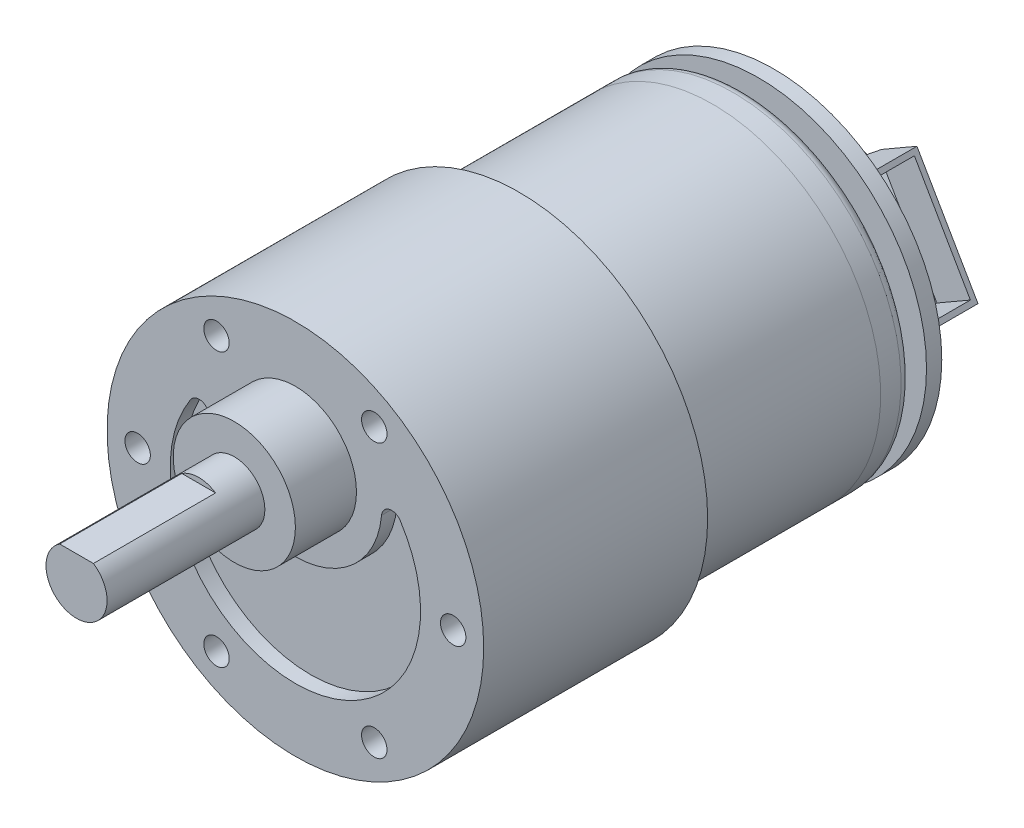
ISO-10303-21;
HEADER;
FILE_DESCRIPTION(('STEP AP214'),'2;1');
FILE_NAME('part.step','',(''),(''),'','','');
FILE_SCHEMA(('AUTOMOTIVE_DESIGN { 1 0 10303 214 1 1 1 1 }'));
ENDSEC;
DATA;
#1=APPLICATION_CONTEXT('core data for automotive mechanical design processes');
#2=APPLICATION_PROTOCOL_DEFINITION('international standard','automotive_design',2000,#1);
#3=PRODUCT_CONTEXT('',#1,'mechanical');
#4=PRODUCT('Part','Part','',(#3));
#5=PRODUCT_RELATED_PRODUCT_CATEGORY('part','',(#4));
#6=PRODUCT_DEFINITION_FORMATION('','',#4);
#7=PRODUCT_DEFINITION_CONTEXT('part definition',#1,'design');
#8=PRODUCT_DEFINITION('design','',#6,#7);
#9=PRODUCT_DEFINITION_SHAPE('','',#8);
#10=(LENGTH_UNIT() NAMED_UNIT(*) SI_UNIT(.MILLI.,.METRE.));
#11=(NAMED_UNIT(*) PLANE_ANGLE_UNIT() SI_UNIT($,.RADIAN.));
#12=(NAMED_UNIT(*) SI_UNIT($,.STERADIAN.) SOLID_ANGLE_UNIT());
#13=UNCERTAINTY_MEASURE_WITH_UNIT(LENGTH_MEASURE(1.E-05),#10,'distance_accuracy_value','');
#14=(GEOMETRIC_REPRESENTATION_CONTEXT(3) GLOBAL_UNCERTAINTY_ASSIGNED_CONTEXT((#13)) GLOBAL_UNIT_ASSIGNED_CONTEXT((#10,
#11,#12)) REPRESENTATION_CONTEXT('',''));
#15=CARTESIAN_POINT('',(0.,0.,0.));
#16=DIRECTION('',(0.,0.,1.));
#17=DIRECTION('',(1.,0.,0.));
#18=AXIS2_PLACEMENT_3D('',#15,#16,#17);
#19=CARTESIAN_POINT('',(9.55736835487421,12.4461524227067,-51.5));
#20=DIRECTION('',(-0.866025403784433,-0.50000000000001,0.));
#21=DIRECTION('',(0.50000000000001,-0.866025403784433,0.));
#22=AXIS2_PLACEMENT_3D('',#19,#20,#21);
#23=PLANE('',#22);
#24=DIRECTION('',(0.50000000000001,-0.866025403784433,0.));
#25=VECTOR('',#24,1.);
#26=CARTESIAN_POINT('',(9.55736835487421,12.4461524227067,-47.));
#27=LINE('',#26,#25);
#28=CARTESIAN_POINT('',(9.55736835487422,12.4461524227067,-47.));
#29=VERTEX_POINT('',#28);
#30=CARTESIAN_POINT('',(15.5573683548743,2.05384757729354,-47.));
#31=VERTEX_POINT('',#30);
#32=EDGE_CURVE('E232',#29,#31,#27,.T.);
#33=ORIENTED_EDGE('',*,*,#32,.T.);
#34=DIRECTION('',(0.,0.,1.));
#35=VECTOR('',#34,1.);
#36=CARTESIAN_POINT('',(15.5573683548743,2.05384757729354,-51.5));
#37=LINE('',#36,#35);
#38=CARTESIAN_POINT('',(15.5573683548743,2.05384757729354,-51.5));
#39=VERTEX_POINT('',#38);
#40=EDGE_CURVE('E236',#39,#31,#37,.T.);
#41=ORIENTED_EDGE('',*,*,#40,.F.);
#42=DIRECTION('',(0.50000000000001,-0.866025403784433,0.));
#43=VECTOR('',#42,1.);
#44=CARTESIAN_POINT('',(9.55736835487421,12.4461524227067,-51.5));
#45=LINE('',#44,#43);
#46=CARTESIAN_POINT('',(9.55736835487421,12.4461524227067,-51.5));
#47=VERTEX_POINT('',#46);
#48=EDGE_CURVE('E234',#47,#39,#45,.T.);
#49=ORIENTED_EDGE('',*,*,#48,.F.);
#50=DIRECTION('',(0.,0.,1.));
#51=VECTOR('',#50,1.);
#52=CARTESIAN_POINT('',(9.55736835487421,12.4461524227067,-51.5));
#53=LINE('',#52,#51);
#54=EDGE_CURVE('E249',#47,#29,#53,.T.);
#55=ORIENTED_EDGE('',*,*,#54,.T.);
#56=EDGE_LOOP('',(#33,#41,#49,#55));
#57=FACE_BOUND('',#56,.T.);
#58=DIRECTION('',(0.,0.,1.));
#59=VECTOR('',#58,1.);
#60=CARTESIAN_POINT('',(15.3073683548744,2.48686027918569,-47.5));
#61=LINE('',#60,#59);
#62=CARTESIAN_POINT('',(15.3073683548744,2.48686027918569,-51.));
#63=VERTEX_POINT('',#62);
#64=CARTESIAN_POINT('',(15.3073683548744,2.48686027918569,-47.5));
#65=VERTEX_POINT('',#64);
#66=EDGE_CURVE('E216',#63,#65,#61,.T.);
#67=ORIENTED_EDGE('',*,*,#66,.T.);
#68=DIRECTION('',(0.500000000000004,-0.866025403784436,0.));
#69=VECTOR('',#68,1.);
#70=CARTESIAN_POINT('',(6.29776715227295,18.0919473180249,-47.5));
#71=LINE('',#70,#69);
#72=CARTESIAN_POINT('',(9.80736835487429,12.0131397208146,-47.5));
#73=VERTEX_POINT('',#72);
#74=EDGE_CURVE('E222',#73,#65,#71,.T.);
#75=ORIENTED_EDGE('',*,*,#74,.F.);
#76=DIRECTION('',(0.,0.,-1.));
#77=VECTOR('',#76,1.);
#78=CARTESIAN_POINT('',(9.80736835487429,12.0131397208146,-47.5));
#79=LINE('',#78,#77);
#80=CARTESIAN_POINT('',(9.80736835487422,12.0131397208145,-51.));
#81=VERTEX_POINT('',#80);
#82=EDGE_CURVE('E862',#73,#81,#79,.T.);
#83=ORIENTED_EDGE('',*,*,#82,.T.);
#84=DIRECTION('',(0.500000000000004,-0.866025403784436,0.));
#85=VECTOR('',#84,1.);
#86=CARTESIAN_POINT('',(6.29776715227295,18.0919473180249,-51.));
#87=LINE('',#86,#85);
#88=EDGE_CURVE('E73',#81,#63,#87,.T.);
#89=ORIENTED_EDGE('',*,*,#88,.T.);
#90=EDGE_LOOP('',(#67,#75,#83,#89));
#91=FACE_BOUND('',#90,.T.);
#92=ADVANCED_FACE('F58',(#57,#91),#23,.F.);
#93=CARTESIAN_POINT('',(0.,0.,-47.));
#94=DIRECTION('',(0.,0.,1.));
#95=DIRECTION('',(1.,0.,0.));
#96=AXIS2_PLACEMENT_3D('',#93,#94,#95);
#97=PLANE('',#96);
#98=CARTESIAN_POINT('',(0.,0.,-47.));
#99=DIRECTION('',(0.,0.,1.));
#100=DIRECTION('',(1.,0.,0.));
#101=AXIS2_PLACEMENT_3D('',#98,#99,#100);
#102=CIRCLE('',#101,2.25);
#103=CARTESIAN_POINT('',(2.25,0.,-47.));
#104=VERTEX_POINT('',#103);
#105=EDGE_CURVE('E265',#104,#104,#102,.T.);
#106=ORIENTED_EDGE('',*,*,#105,.T.);
#107=EDGE_LOOP('',(#106));
#108=FACE_BOUND('',#107,.T.);
#109=CARTESIAN_POINT('',(0.,0.,-47.));
#110=DIRECTION('',(0.,0.,1.));
#111=DIRECTION('',(1.,0.,0.));
#112=AXIS2_PLACEMENT_3D('',#109,#110,#111);
#113=CIRCLE('',#112,16.5);
#114=CARTESIAN_POINT('',(16.5,0.,-47.));
#115=VERTEX_POINT('',#114);
#116=EDGE_CURVE('E290',#115,#115,#113,.T.);
#117=ORIENTED_EDGE('',*,*,#116,.F.);
#118=EDGE_LOOP('',(#117));
#119=FACE_BOUND('',#118,.T.);
#120=DIRECTION('',(-0.866025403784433,-0.500000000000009,0.));
#121=VECTOR('',#120,1.);
#122=CARTESIAN_POINT('',(15.5573683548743,2.05384757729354,-47.));
#123=LINE('',#122,#121);
#124=CARTESIAN_POINT('',(10.3612159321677,-0.946152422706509,-47.));
#125=VERTEX_POINT('',#124);
#126=EDGE_CURVE('E227',#31,#125,#123,.T.);
#127=ORIENTED_EDGE('',*,*,#126,.F.);
#128=ORIENTED_EDGE('',*,*,#32,.F.);
#129=DIRECTION('',(0.866025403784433,0.50000000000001,0.));
#130=VECTOR('',#129,1.);
#131=CARTESIAN_POINT('',(4.36121593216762,9.44615242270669,-47.));
#132=LINE('',#131,#130);
#133=CARTESIAN_POINT('',(4.36121593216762,9.44615242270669,-47.));
#134=VERTEX_POINT('',#133);
#135=EDGE_CURVE('E242',#134,#29,#132,.T.);
#136=ORIENTED_EDGE('',*,*,#135,.F.);
#137=DIRECTION('',(-0.50000000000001,0.866025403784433,0.));
#138=VECTOR('',#137,1.);
#139=CARTESIAN_POINT('',(10.3612159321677,-0.94615242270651,-47.));
#140=LINE('',#139,#138);
#141=EDGE_CURVE('E239',#125,#134,#140,.T.);
#142=ORIENTED_EDGE('',*,*,#141,.F.);
#143=EDGE_LOOP('',(#127,#128,#136,#142));
#144=FACE_BOUND('',#143,.T.);
#145=ADVANCED_FACE('F398',(#108,#119,#144),#97,.F.);
#146=CARTESIAN_POINT('',(0.,0.,-44.));
#147=DIRECTION('',(0.,0.,-1.));
#148=DIRECTION('',(-1.,0.,0.));
#149=AXIS2_PLACEMENT_3D('',#146,#147,#148);
#150=PLANE('',#149);
#151=CARTESIAN_POINT('',(0.,0.,-44.));
#152=DIRECTION('',(0.,0.,-1.));
#153=DIRECTION('',(-1.,0.,0.));
#154=AXIS2_PLACEMENT_3D('',#151,#152,#153);
#155=CIRCLE('',#154,1.5);
#156=CARTESIAN_POINT('',(-1.5,0.,-44.));
#157=VERTEX_POINT('',#156);
#158=EDGE_CURVE('E342',#157,#157,#155,.T.);
#159=ORIENTED_EDGE('',*,*,#158,.F.);
#160=EDGE_LOOP('',(#159));
#161=FACE_BOUND('',#160,.T.);
#162=CARTESIAN_POINT('',(0.,0.,-44.));
#163=DIRECTION('',(0.,0.,-1.));
#164=DIRECTION('',(-1.,0.,0.));
#165=AXIS2_PLACEMENT_3D('',#162,#163,#164);
#166=CIRCLE('',#165,15.5);
#167=CARTESIAN_POINT('',(-15.5,0.,-44.));
#168=VERTEX_POINT('',#167);
#169=EDGE_CURVE('E336',#168,#168,#166,.T.);
#170=ORIENTED_EDGE('',*,*,#169,.T.);
#171=EDGE_LOOP('',(#170));
#172=FACE_BOUND('',#171,.T.);
#173=DIRECTION('',(0.,-1.,0.));
#174=VECTOR('',#173,1.);
#175=CARTESIAN_POINT('',(-12.,1.5,-44.));
#176=LINE('',#175,#174);
#177=CARTESIAN_POINT('',(-12.,1.5,-44.));
#178=VERTEX_POINT('',#177);
#179=CARTESIAN_POINT('',(-12.,-1.5,-44.));
#180=VERTEX_POINT('',#179);
#181=EDGE_CURVE('E299',#178,#180,#176,.T.);
#182=ORIENTED_EDGE('',*,*,#181,.F.);
#183=DIRECTION('',(1.,0.,0.));
#184=VECTOR('',#183,1.);
#185=CARTESIAN_POINT('',(-13.,1.5,-44.));
#186=LINE('',#185,#184);
#187=CARTESIAN_POINT('',(-13.,1.5,-44.));
#188=VERTEX_POINT('',#187);
#189=EDGE_CURVE('E303',#188,#178,#186,.T.);
#190=ORIENTED_EDGE('',*,*,#189,.F.);
#191=DIRECTION('',(0.,1.,0.));
#192=VECTOR('',#191,1.);
#193=CARTESIAN_POINT('',(-13.,1.5,-44.));
#194=LINE('',#193,#192);
#195=CARTESIAN_POINT('',(-13.,-1.5,-44.));
#196=VERTEX_POINT('',#195);
#197=EDGE_CURVE('E305',#196,#188,#194,.T.);
#198=ORIENTED_EDGE('',*,*,#197,.F.);
#199=DIRECTION('',(-1.,0.,0.));
#200=VECTOR('',#199,1.);
#201=CARTESIAN_POINT('',(-13.,-1.5,-44.));
#202=LINE('',#201,#200);
#203=EDGE_CURVE('E302',#180,#196,#202,.T.);
#204=ORIENTED_EDGE('',*,*,#203,.F.);
#205=EDGE_LOOP('',(#182,#190,#198,#204));
#206=FACE_BOUND('',#205,.T.);
#207=DIRECTION('',(-1.,0.,0.));
#208=VECTOR('',#207,1.);
#209=CARTESIAN_POINT('',(13.,-1.5,-44.));
#210=LINE('',#209,#208);
#211=CARTESIAN_POINT('',(13.,-1.5,-44.));
#212=VERTEX_POINT('',#211);
#213=CARTESIAN_POINT('',(12.,-1.5,-44.));
#214=VERTEX_POINT('',#213);
#215=EDGE_CURVE('E257',#212,#214,#210,.T.);
#216=ORIENTED_EDGE('',*,*,#215,.F.);
#217=DIRECTION('',(0.,-1.,0.));
#218=VECTOR('',#217,1.);
#219=CARTESIAN_POINT('',(13.,1.5,-44.));
#220=LINE('',#219,#218);
#221=CARTESIAN_POINT('',(13.,1.5,-44.));
#222=VERTEX_POINT('',#221);
#223=EDGE_CURVE('E261',#222,#212,#220,.T.);
#224=ORIENTED_EDGE('',*,*,#223,.F.);
#225=DIRECTION('',(1.,0.,0.));
#226=VECTOR('',#225,1.);
#227=CARTESIAN_POINT('',(13.,1.5,-44.));
#228=LINE('',#227,#226);
#229=CARTESIAN_POINT('',(12.,1.5,-44.));
#230=VERTEX_POINT('',#229);
#231=EDGE_CURVE('E263',#230,#222,#228,.T.);
#232=ORIENTED_EDGE('',*,*,#231,.F.);
#233=DIRECTION('',(0.,1.,0.));
#234=VECTOR('',#233,1.);
#235=CARTESIAN_POINT('',(12.,1.5,-44.));
#236=LINE('',#235,#234);
#237=EDGE_CURVE('E260',#214,#230,#236,.T.);
#238=ORIENTED_EDGE('',*,*,#237,.F.);
#239=EDGE_LOOP('',(#216,#224,#232,#238));
#240=FACE_BOUND('',#239,.T.);
#241=ADVANCED_FACE('F404',(#161,#172,#206,#240),#150,.T.);
#242=CARTESIAN_POINT('',(0.,0.,-45.5));
#243=DIRECTION('',(0.,0.,1.));
#244=DIRECTION('',(1.,0.,0.));
#245=AXIS2_PLACEMENT_3D('',#242,#243,#244);
#246=PLANE('',#245);
#247=CARTESIAN_POINT('',(0.,0.,-45.5));
#248=DIRECTION('',(0.,0.,1.));
#249=DIRECTION('',(1.,0.,0.));
#250=AXIS2_PLACEMENT_3D('',#247,#248,#249);
#251=CIRCLE('',#250,2.25);
#252=CARTESIAN_POINT('',(2.25,0.,-45.5));
#253=VERTEX_POINT('',#252);
#254=EDGE_CURVE('E287',#253,#253,#251,.T.);
#255=ORIENTED_EDGE('',*,*,#254,.F.);
#256=EDGE_LOOP('',(#255));
#257=FACE_BOUND('',#256,.T.);
#258=CARTESIAN_POINT('',(0.,0.,-45.5));
#259=DIRECTION('',(0.,0.,1.));
#260=DIRECTION('',(1.,0.,0.));
#261=AXIS2_PLACEMENT_3D('',#258,#259,#260);
#262=CIRCLE('',#261,16.5);
#263=CARTESIAN_POINT('',(16.5,0.,-45.5));
#264=VERTEX_POINT('',#263);
#265=EDGE_CURVE('E293',#264,#264,#262,.T.);
#266=ORIENTED_EDGE('',*,*,#265,.T.);
#267=EDGE_LOOP('',(#266));
#268=FACE_BOUND('',#267,.T.);
#269=DIRECTION('',(0.,-1.,0.));
#270=VECTOR('',#269,1.);
#271=CARTESIAN_POINT('',(-13.,1.5,-45.5));
#272=LINE('',#271,#270);
#273=CARTESIAN_POINT('',(-13.,1.5,-45.5));
#274=VERTEX_POINT('',#273);
#275=CARTESIAN_POINT('',(-13.,-1.5,-45.5));
#276=VERTEX_POINT('',#275);
#277=EDGE_CURVE('E296',#274,#276,#272,.T.);
#278=ORIENTED_EDGE('',*,*,#277,.F.);
#279=DIRECTION('',(-1.,0.,0.));
#280=VECTOR('',#279,1.);
#281=CARTESIAN_POINT('',(-13.,1.5,-45.5));
#282=LINE('',#281,#280);
#283=CARTESIAN_POINT('',(-12.,1.5,-45.5));
#284=VERTEX_POINT('',#283);
#285=EDGE_CURVE('E316',#284,#274,#282,.T.);
#286=ORIENTED_EDGE('',*,*,#285,.F.);
#287=DIRECTION('',(0.,1.,0.));
#288=VECTOR('',#287,1.);
#289=CARTESIAN_POINT('',(-12.,1.5,-45.5));
#290=LINE('',#289,#288);
#291=CARTESIAN_POINT('',(-12.,-1.5,-45.5));
#292=VERTEX_POINT('',#291);
#293=EDGE_CURVE('E313',#292,#284,#290,.T.);
#294=ORIENTED_EDGE('',*,*,#293,.F.);
#295=DIRECTION('',(1.,0.,0.));
#296=VECTOR('',#295,1.);
#297=CARTESIAN_POINT('',(-13.,-1.5,-45.5));
#298=LINE('',#297,#296);
#299=EDGE_CURVE('E310',#276,#292,#298,.T.);
#300=ORIENTED_EDGE('',*,*,#299,.F.);
#301=EDGE_LOOP('',(#278,#286,#294,#300));
#302=FACE_BOUND('',#301,.T.);
#303=DIRECTION('',(-1.,0.,0.));
#304=VECTOR('',#303,1.);
#305=CARTESIAN_POINT('',(13.,1.5,-45.5));
#306=LINE('',#305,#304);
#307=CARTESIAN_POINT('',(13.,1.5,-45.5));
#308=VERTEX_POINT('',#307);
#309=CARTESIAN_POINT('',(12.,1.5,-45.5));
#310=VERTEX_POINT('',#309);
#311=EDGE_CURVE('E256',#308,#310,#306,.T.);
#312=ORIENTED_EDGE('',*,*,#311,.F.);
#313=DIRECTION('',(0.,1.,0.));
#314=VECTOR('',#313,1.);
#315=CARTESIAN_POINT('',(13.,1.5,-45.5));
#316=LINE('',#315,#314);
#317=CARTESIAN_POINT('',(13.,-1.5,-45.5));
#318=VERTEX_POINT('',#317);
#319=EDGE_CURVE('E274',#318,#308,#316,.T.);
#320=ORIENTED_EDGE('',*,*,#319,.F.);
#321=DIRECTION('',(1.,0.,0.));
#322=VECTOR('',#321,1.);
#323=CARTESIAN_POINT('',(13.,-1.5,-45.5));
#324=LINE('',#323,#322);
#325=CARTESIAN_POINT('',(12.,-1.5,-45.5));
#326=VERTEX_POINT('',#325);
#327=EDGE_CURVE('E271',#326,#318,#324,.T.);
#328=ORIENTED_EDGE('',*,*,#327,.F.);
#329=DIRECTION('',(0.,-1.,0.));
#330=VECTOR('',#329,1.);
#331=CARTESIAN_POINT('',(12.,1.5,-45.5));
#332=LINE('',#331,#330);
#333=EDGE_CURVE('E268',#310,#326,#332,.T.);
#334=ORIENTED_EDGE('',*,*,#333,.F.);
#335=EDGE_LOOP('',(#312,#320,#328,#334));
#336=FACE_BOUND('',#335,.T.);
#337=ADVANCED_FACE('F444',(#257,#268,#302,#336),#246,.T.);
#338=CARTESIAN_POINT('',(0.,0.,-54.5));
#339=DIRECTION('',(0.,0.,1.));
#340=DIRECTION('',(1.,0.,0.));
#341=AXIS2_PLACEMENT_3D('',#338,#339,#340);
#342=CYLINDRICAL_SURFACE('',#341,1.5);
#343=ORIENTED_EDGE('',*,*,#158,.T.);
#344=EDGE_LOOP('',(#343));
#345=FACE_BOUND('',#344,.T.);
#346=CARTESIAN_POINT('',(0.,0.,-50.5));
#347=DIRECTION('',(0.,0.,-1.));
#348=DIRECTION('',(-1.,0.,0.));
#349=AXIS2_PLACEMENT_3D('',#346,#347,#348);
#350=CIRCLE('',#349,1.5);
#351=CARTESIAN_POINT('',(-1.5,0.,-50.5));
#352=VERTEX_POINT('',#351);
#353=EDGE_CURVE('E307',#352,#352,#350,.F.);
#354=ORIENTED_EDGE('',*,*,#353,.T.);
#355=EDGE_LOOP('',(#354));
#356=FACE_BOUND('',#355,.T.);
#357=ADVANCED_FACE('F446',(#345,#356),#342,.T.);
#358=CARTESIAN_POINT('',(0.,0.,-44.));
#359=DIRECTION('',(0.,0.,1.));
#360=DIRECTION('',(1.,0.,0.));
#361=AXIS2_PLACEMENT_3D('',#358,#359,#360);
#362=CYLINDRICAL_SURFACE('',#361,16.5);
#363=CARTESIAN_POINT('',(0.,0.,-43.));
#364=DIRECTION('',(0.,0.,-1.));
#365=DIRECTION('',(-1.,0.,0.));
#366=AXIS2_PLACEMENT_3D('',#363,#364,#365);
#367=CIRCLE('',#366,16.5);
#368=CARTESIAN_POINT('',(-16.5,0.,-43.));
#369=VERTEX_POINT('',#368);
#370=EDGE_CURVE('E339',#369,#369,#367,.F.);
#371=ORIENTED_EDGE('',*,*,#370,.T.);
#372=EDGE_LOOP('',(#371));
#373=FACE_BOUND('',#372,.T.);
#374=CARTESIAN_POINT('',(0.,0.,-41.));
#375=DIRECTION('',(0.,0.,-1.));
#376=DIRECTION('',(-1.,0.,0.));
#377=AXIS2_PLACEMENT_3D('',#374,#375,#376);
#378=CIRCLE('',#377,16.5);
#379=CARTESIAN_POINT('',(-16.5,0.,-41.));
#380=VERTEX_POINT('',#379);
#381=EDGE_CURVE('E333',#380,#380,#378,.T.);
#382=ORIENTED_EDGE('',*,*,#381,.T.);
#383=EDGE_LOOP('',(#382));
#384=FACE_BOUND('',#383,.T.);
#385=ADVANCED_FACE('F479',(#373,#384),#362,.T.);
#386=CARTESIAN_POINT('',(0.,0.,-41.));
#387=DIRECTION('',(0.,0.,-1.));
#388=DIRECTION('',(-1.,0.,0.));
#389=AXIS2_PLACEMENT_3D('',#386,#387,#388);
#390=PLANE('',#389);
#391=ORIENTED_EDGE('',*,*,#381,.F.);
#392=EDGE_LOOP('',(#391));
#393=FACE_BOUND('',#392,.T.);
#394=ADVANCED_FACE('F484',(#393),#390,.F.);
#395=CARTESIAN_POINT('',(0.,0.,-43.));
#396=DIRECTION('',(0.,0.,-1.));
#397=DIRECTION('',(-1.,0.,0.));
#398=AXIS2_PLACEMENT_3D('',#395,#396,#397);
#399=TOROIDAL_SURFACE('',#398,15.5,1.);
#400=ORIENTED_EDGE('',*,*,#370,.F.);
#401=EDGE_LOOP('',(#400));
#402=FACE_BOUND('',#401,.T.);
#403=ORIENTED_EDGE('',*,*,#169,.F.);
#404=EDGE_LOOP('',(#403));
#405=FACE_BOUND('',#404,.T.);
#406=ADVANCED_FACE('F473',(#402,#405),#399,.T.);
#407=CARTESIAN_POINT('',(0.,0.,-50.5));
#408=DIRECTION('',(0.,0.,-1.));
#409=DIRECTION('',(-1.,0.,0.));
#410=AXIS2_PLACEMENT_3D('',#407,#408,#409);
#411=CYLINDRICAL_SURFACE('',#410,7.5);
#412=CARTESIAN_POINT('',(0.,0.,-53.5));
#413=DIRECTION('',(0.,0.,-1.));
#414=DIRECTION('',(-1.,0.,0.));
#415=AXIS2_PLACEMENT_3D('',#412,#413,#414);
#416=CIRCLE('',#415,7.5);
#417=CARTESIAN_POINT('',(-7.5,0.,-53.5));
#418=VERTEX_POINT('',#417);
#419=EDGE_CURVE('E66',#418,#418,#416,.F.);
#420=ORIENTED_EDGE('',*,*,#419,.T.);
#421=EDGE_LOOP('',(#420));
#422=FACE_BOUND('',#421,.T.);
#423=CARTESIAN_POINT('',(0.,0.,-51.));
#424=DIRECTION('',(0.,0.,-1.));
#425=DIRECTION('',(-1.,0.,0.));
#426=AXIS2_PLACEMENT_3D('',#423,#424,#425);
#427=CIRCLE('',#426,7.5);
#428=CARTESIAN_POINT('',(-7.5,0.,-51.));
#429=VERTEX_POINT('',#428);
#430=EDGE_CURVE('E364',#429,#429,#427,.T.);
#431=ORIENTED_EDGE('',*,*,#430,.T.);
#432=EDGE_LOOP('',(#431));
#433=FACE_BOUND('',#432,.T.);
#434=ADVANCED_FACE('F369',(#422,#433),#411,.T.);
#435=CARTESIAN_POINT('',(0.,0.,-50.5));
#436=DIRECTION('',(0.,0.,-1.));
#437=DIRECTION('',(-1.,0.,0.));
#438=AXIS2_PLACEMENT_3D('',#435,#436,#437);
#439=PLANE('',#438);
#440=CARTESIAN_POINT('',(0.,0.,-50.5));
#441=DIRECTION('',(0.,0.,-1.));
#442=DIRECTION('',(-1.,0.,0.));
#443=AXIS2_PLACEMENT_3D('',#440,#441,#442);
#444=CIRCLE('',#443,7.);
#445=CARTESIAN_POINT('',(-7.,0.,-50.5));
#446=VERTEX_POINT('',#445);
#447=EDGE_CURVE('E14',#446,#446,#444,.F.);
#448=ORIENTED_EDGE('',*,*,#447,.T.);
#449=EDGE_LOOP('',(#448));
#450=FACE_BOUND('',#449,.T.);
#451=ORIENTED_EDGE('',*,*,#353,.F.);
#452=EDGE_LOOP('',(#451));
#453=FACE_BOUND('',#452,.T.);
#454=ADVANCED_FACE('F382',(#450,#453),#439,.F.);
#455=CARTESIAN_POINT('',(0.,0.,-54.));
#456=DIRECTION('',(0.,0.,-1.));
#457=DIRECTION('',(-1.,0.,0.));
#458=AXIS2_PLACEMENT_3D('',#455,#456,#457);
#459=PLANE('',#458);
#460=CARTESIAN_POINT('',(0.,0.,-54.));
#461=DIRECTION('',(0.,0.,-1.));
#462=DIRECTION('',(-1.,0.,0.));
#463=AXIS2_PLACEMENT_3D('',#460,#461,#462);
#464=CIRCLE('',#463,7.);
#465=CARTESIAN_POINT('',(-7.,0.,-54.));
#466=VERTEX_POINT('',#465);
#467=EDGE_CURVE('E361',#466,#466,#464,.T.);
#468=ORIENTED_EDGE('',*,*,#467,.T.);
#469=EDGE_LOOP('',(#468));
#470=FACE_BOUND('',#469,.T.);
#471=CARTESIAN_POINT('',(0.,0.,-54.));
#472=DIRECTION('',(0.,0.,-1.));
#473=DIRECTION('',(-1.,0.,0.));
#474=AXIS2_PLACEMENT_3D('',#471,#472,#473);
#475=CIRCLE('',#474,1.5);
#476=CARTESIAN_POINT('',(-1.5,0.,-54.));
#477=VERTEX_POINT('',#476);
#478=EDGE_CURVE('E345',#477,#477,#475,.F.);
#479=ORIENTED_EDGE('',*,*,#478,.T.);
#480=EDGE_LOOP('',(#479));
#481=FACE_BOUND('',#480,.T.);
#482=ADVANCED_FACE('F378',(#470,#481),#459,.T.);
#483=CARTESIAN_POINT('',(0.,0.,-54.5));
#484=DIRECTION('',(0.,0.,1.));
#485=DIRECTION('',(1.,0.,0.));
#486=AXIS2_PLACEMENT_3D('',#483,#484,#485);
#487=PLANE('',#486);
#488=CARTESIAN_POINT('',(0.,0.,-54.5));
#489=DIRECTION('',(0.,0.,1.));
#490=DIRECTION('',(1.,0.,0.));
#491=AXIS2_PLACEMENT_3D('',#488,#489,#490);
#492=CIRCLE('',#491,0.633974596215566);
#493=CARTESIAN_POINT('',(0.633974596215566,0.,-54.5));
#494=VERTEX_POINT('',#493);
#495=EDGE_CURVE('E358',#494,#494,#492,.F.);
#496=ORIENTED_EDGE('',*,*,#495,.T.);
#497=EDGE_LOOP('',(#496));
#498=FACE_BOUND('',#497,.T.);
#499=ADVANCED_FACE('F381',(#498),#487,.F.);
#500=CARTESIAN_POINT('',(-13.,1.5,-40.8377223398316));
#501=DIRECTION('',(0.,-1.,0.));
#502=DIRECTION('',(0.,0.,-1.));
#503=AXIS2_PLACEMENT_3D('',#500,#501,#502);
#504=PLANE('',#503);
#505=DIRECTION('',(0.,0.,-1.));
#506=VECTOR('',#505,1.);
#507=CARTESIAN_POINT('',(-13.,1.5,-40.8377223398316));
#508=LINE('',#507,#506);
#509=EDGE_CURVE('E319',#188,#274,#508,.T.);
#510=ORIENTED_EDGE('',*,*,#509,.F.);
#511=ORIENTED_EDGE('',*,*,#189,.T.);
#512=DIRECTION('',(0.,0.,-1.));
#513=VECTOR('',#512,1.);
#514=CARTESIAN_POINT('',(-12.,1.5,-40.8377223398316));
#515=LINE('',#514,#513);
#516=EDGE_CURVE('E322',#178,#284,#515,.T.);
#517=ORIENTED_EDGE('',*,*,#516,.T.);
#518=ORIENTED_EDGE('',*,*,#285,.T.);
#519=EDGE_LOOP('',(#510,#511,#517,#518));
#520=FACE_BOUND('',#519,.T.);
#521=ADVANCED_FACE('F453',(#520),#504,.F.);
#522=CARTESIAN_POINT('',(-12.,1.5,-40.8377223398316));
#523=DIRECTION('',(-1.,0.,0.));
#524=DIRECTION('',(0.,0.,1.));
#525=AXIS2_PLACEMENT_3D('',#522,#523,#524);
#526=PLANE('',#525);
#527=ORIENTED_EDGE('',*,*,#516,.F.);
#528=ORIENTED_EDGE('',*,*,#181,.T.);
#529=DIRECTION('',(0.,0.,-1.));
#530=VECTOR('',#529,1.);
#531=CARTESIAN_POINT('',(-12.,-1.5,-40.8377223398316));
#532=LINE('',#531,#530);
#533=EDGE_CURVE('E325',#180,#292,#532,.T.);
#534=ORIENTED_EDGE('',*,*,#533,.T.);
#535=ORIENTED_EDGE('',*,*,#293,.T.);
#536=EDGE_LOOP('',(#527,#528,#534,#535));
#537=FACE_BOUND('',#536,.T.);
#538=ADVANCED_FACE('F456',(#537),#526,.F.);
#539=CARTESIAN_POINT('',(-13.,-1.5,-40.8377223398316));
#540=DIRECTION('',(0.,1.,0.));
#541=DIRECTION('',(0.,0.,1.));
#542=AXIS2_PLACEMENT_3D('',#539,#540,#541);
#543=PLANE('',#542);
#544=ORIENTED_EDGE('',*,*,#533,.F.);
#545=ORIENTED_EDGE('',*,*,#203,.T.);
#546=DIRECTION('',(0.,0.,-1.));
#547=VECTOR('',#546,1.);
#548=CARTESIAN_POINT('',(-13.,-1.5,-40.8377223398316));
#549=LINE('',#548,#547);
#550=EDGE_CURVE('E328',#196,#276,#549,.T.);
#551=ORIENTED_EDGE('',*,*,#550,.T.);
#552=ORIENTED_EDGE('',*,*,#299,.T.);
#553=EDGE_LOOP('',(#544,#545,#551,#552));
#554=FACE_BOUND('',#553,.T.);
#555=ADVANCED_FACE('F460',(#554),#543,.F.);
#556=CARTESIAN_POINT('',(-13.,1.5,-40.8377223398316));
#557=DIRECTION('',(1.,0.,0.));
#558=DIRECTION('',(0.,0.,-1.));
#559=AXIS2_PLACEMENT_3D('',#556,#557,#558);
#560=PLANE('',#559);
#561=ORIENTED_EDGE('',*,*,#550,.F.);
#562=ORIENTED_EDGE('',*,*,#197,.T.);
#563=ORIENTED_EDGE('',*,*,#509,.T.);
#564=ORIENTED_EDGE('',*,*,#277,.T.);
#565=EDGE_LOOP('',(#561,#562,#563,#564));
#566=FACE_BOUND('',#565,.T.);
#567=ADVANCED_FACE('F451',(#566),#560,.F.);
#568=CARTESIAN_POINT('',(0.,0.,-45.5));
#569=DIRECTION('',(0.,0.,-1.));
#570=DIRECTION('',(-1.,0.,0.));
#571=AXIS2_PLACEMENT_3D('',#568,#569,#570);
#572=CYLINDRICAL_SURFACE('',#571,16.5);
#573=ORIENTED_EDGE('',*,*,#265,.F.);
#574=EDGE_LOOP('',(#573));
#575=FACE_BOUND('',#574,.T.);
#576=ORIENTED_EDGE('',*,*,#116,.T.);
#577=EDGE_LOOP('',(#576));
#578=FACE_BOUND('',#577,.T.);
#579=ADVANCED_FACE('F442',(#575,#578),#572,.T.);
#580=CARTESIAN_POINT('',(0.,0.,-45.5));
#581=DIRECTION('',(0.,0.,-1.));
#582=DIRECTION('',(-1.,0.,0.));
#583=AXIS2_PLACEMENT_3D('',#580,#581,#582);
#584=CYLINDRICAL_SURFACE('',#583,2.25);
#585=ORIENTED_EDGE('',*,*,#254,.T.);
#586=EDGE_LOOP('',(#585));
#587=FACE_BOUND('',#586,.T.);
#588=ORIENTED_EDGE('',*,*,#105,.F.);
#589=EDGE_LOOP('',(#588));
#590=FACE_BOUND('',#589,.T.);
#591=ADVANCED_FACE('F428',(#587,#590),#584,.F.);
#592=CARTESIAN_POINT('',(13.,1.5,-40.8377223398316));
#593=DIRECTION('',(-1.,0.,0.));
#594=DIRECTION('',(0.,0.,1.));
#595=AXIS2_PLACEMENT_3D('',#592,#593,#594);
#596=PLANE('',#595);
#597=DIRECTION('',(0.,0.,-1.));
#598=VECTOR('',#597,1.);
#599=CARTESIAN_POINT('',(13.,1.5,-40.8377223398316));
#600=LINE('',#599,#598);
#601=EDGE_CURVE('E276',#222,#308,#600,.T.);
#602=ORIENTED_EDGE('',*,*,#601,.F.);
#603=ORIENTED_EDGE('',*,*,#223,.T.);
#604=DIRECTION('',(0.,0.,-1.));
#605=VECTOR('',#604,1.);
#606=CARTESIAN_POINT('',(13.,-1.5,-40.8377223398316));
#607=LINE('',#606,#605);
#608=EDGE_CURVE('E279',#212,#318,#607,.T.);
#609=ORIENTED_EDGE('',*,*,#608,.T.);
#610=ORIENTED_EDGE('',*,*,#319,.T.);
#611=EDGE_LOOP('',(#602,#603,#609,#610));
#612=FACE_BOUND('',#611,.T.);
#613=ADVANCED_FACE('F424',(#612),#596,.F.);
#614=CARTESIAN_POINT('',(13.,-1.5,-40.8377223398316));
#615=DIRECTION('',(0.,1.,0.));
#616=DIRECTION('',(0.,0.,1.));
#617=AXIS2_PLACEMENT_3D('',#614,#615,#616);
#618=PLANE('',#617);
#619=ORIENTED_EDGE('',*,*,#608,.F.);
#620=ORIENTED_EDGE('',*,*,#215,.T.);
#621=DIRECTION('',(0.,0.,-1.));
#622=VECTOR('',#621,1.);
#623=CARTESIAN_POINT('',(12.,-1.5,-40.8377223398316));
#624=LINE('',#623,#622);
#625=EDGE_CURVE('E281',#214,#326,#624,.T.);
#626=ORIENTED_EDGE('',*,*,#625,.T.);
#627=ORIENTED_EDGE('',*,*,#327,.T.);
#628=EDGE_LOOP('',(#619,#620,#626,#627));
#629=FACE_BOUND('',#628,.T.);
#630=ADVANCED_FACE('F427',(#629),#618,.F.);
#631=CARTESIAN_POINT('',(12.,1.5,-40.8377223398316));
#632=DIRECTION('',(1.,0.,0.));
#633=DIRECTION('',(0.,0.,-1.));
#634=AXIS2_PLACEMENT_3D('',#631,#632,#633);
#635=PLANE('',#634);
#636=ORIENTED_EDGE('',*,*,#625,.F.);
#637=ORIENTED_EDGE('',*,*,#237,.T.);
#638=DIRECTION('',(0.,0.,-1.));
#639=VECTOR('',#638,1.);
#640=CARTESIAN_POINT('',(12.,1.5,-40.8377223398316));
#641=LINE('',#640,#639);
#642=EDGE_CURVE('E283',#230,#310,#641,.T.);
#643=ORIENTED_EDGE('',*,*,#642,.T.);
#644=ORIENTED_EDGE('',*,*,#333,.T.);
#645=EDGE_LOOP('',(#636,#637,#643,#644));
#646=FACE_BOUND('',#645,.T.);
#647=ADVANCED_FACE('F432',(#646),#635,.F.);
#648=CARTESIAN_POINT('',(13.,1.5,-40.8377223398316));
#649=DIRECTION('',(0.,-1.,0.));
#650=DIRECTION('',(0.,0.,-1.));
#651=AXIS2_PLACEMENT_3D('',#648,#649,#650);
#652=PLANE('',#651);
#653=ORIENTED_EDGE('',*,*,#642,.F.);
#654=ORIENTED_EDGE('',*,*,#231,.T.);
#655=ORIENTED_EDGE('',*,*,#601,.T.);
#656=ORIENTED_EDGE('',*,*,#311,.T.);
#657=EDGE_LOOP('',(#653,#654,#655,#656));
#658=FACE_BOUND('',#657,.T.);
#659=ADVANCED_FACE('F422',(#658),#652,.F.);
#660=CARTESIAN_POINT('',(15.5573683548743,2.05384757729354,-51.5));
#661=DIRECTION('',(-0.500000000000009,0.866025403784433,0.));
#662=DIRECTION('',(-0.866025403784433,-0.500000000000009,0.));
#663=AXIS2_PLACEMENT_3D('',#660,#661,#662);
#664=PLANE('',#663);
#665=DIRECTION('',(0.,0.,1.));
#666=VECTOR('',#665,1.);
#667=CARTESIAN_POINT('',(10.3612159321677,-0.94615242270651,-51.5));
#668=LINE('',#667,#666);
#669=CARTESIAN_POINT('',(10.3612159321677,-0.94615242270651,-49.5));
#670=VERTEX_POINT('',#669);
#671=EDGE_CURVE('E254',#670,#125,#668,.T.);
#672=ORIENTED_EDGE('',*,*,#671,.F.);
#673=DIRECTION('',(0.612372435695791,0.35355339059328,-0.707106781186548));
#674=VECTOR('',#673,1.);
#675=CARTESIAN_POINT('',(12.0932667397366,0.0538475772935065,-51.5));
#676=LINE('',#675,#674);
#677=CARTESIAN_POINT('',(12.0932667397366,0.0538475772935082,-51.5));
#678=VERTEX_POINT('',#677);
#679=EDGE_CURVE('E356',#670,#678,#676,.T.);
#680=ORIENTED_EDGE('',*,*,#679,.T.);
#681=DIRECTION('',(-0.866025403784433,-0.500000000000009,0.));
#682=VECTOR('',#681,1.);
#683=CARTESIAN_POINT('',(15.5573683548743,2.05384757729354,-51.5));
#684=LINE('',#683,#682);
#685=EDGE_CURVE('E228',#39,#678,#684,.T.);
#686=ORIENTED_EDGE('',*,*,#685,.F.);
#687=ORIENTED_EDGE('',*,*,#40,.T.);
#688=ORIENTED_EDGE('',*,*,#126,.T.);
#689=EDGE_LOOP('',(#672,#680,#686,#687,#688));
#690=FACE_BOUND('',#689,.T.);
#691=ADVANCED_FACE('F419',(#690),#664,.F.);
#692=CARTESIAN_POINT('',(10.3612159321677,-0.94615242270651,-51.5));
#693=DIRECTION('',(0.866025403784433,0.50000000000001,0.));
#694=DIRECTION('',(-0.50000000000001,0.866025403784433,0.));
#695=AXIS2_PLACEMENT_3D('',#692,#693,#694);
#696=PLANE('',#695);
#697=DIRECTION('',(0.,0.,1.));
#698=VECTOR('',#697,1.);
#699=CARTESIAN_POINT('',(4.36121593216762,9.44615242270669,-51.5));
#700=LINE('',#699,#698);
#701=CARTESIAN_POINT('',(4.36121593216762,9.44615242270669,-49.5));
#702=VERTEX_POINT('',#701);
#703=EDGE_CURVE('E252',#702,#134,#700,.T.);
#704=ORIENTED_EDGE('',*,*,#703,.F.);
#705=DIRECTION('',(0.50000000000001,-0.866025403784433,0.));
#706=VECTOR('',#705,1.);
#707=CARTESIAN_POINT('',(10.3612159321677,-0.94615242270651,-49.5));
#708=LINE('',#707,#706);
#709=EDGE_CURVE('E81',#702,#670,#708,.T.);
#710=ORIENTED_EDGE('',*,*,#709,.T.);
#711=ORIENTED_EDGE('',*,*,#671,.T.);
#712=ORIENTED_EDGE('',*,*,#141,.T.);
#713=EDGE_LOOP('',(#704,#710,#711,#712));
#714=FACE_BOUND('',#713,.T.);
#715=ADVANCED_FACE('F415',(#714),#696,.F.);
#716=CARTESIAN_POINT('',(4.36121593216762,9.44615242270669,-51.5));
#717=DIRECTION('',(0.50000000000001,-0.866025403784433,0.));
#718=DIRECTION('',(0.866025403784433,0.50000000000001,0.));
#719=AXIS2_PLACEMENT_3D('',#716,#717,#718);
#720=PLANE('',#719);
#721=DIRECTION('',(0.866025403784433,0.50000000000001,0.));
#722=VECTOR('',#721,1.);
#723=CARTESIAN_POINT('',(4.36121593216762,9.44615242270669,-51.5));
#724=LINE('',#723,#722);
#725=CARTESIAN_POINT('',(6.09326673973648,10.4461524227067,-51.5));
#726=VERTEX_POINT('',#725);
#727=EDGE_CURVE('E231',#726,#47,#724,.T.);
#728=ORIENTED_EDGE('',*,*,#727,.F.);
#729=DIRECTION('',(-0.61237243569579,-0.353553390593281,0.707106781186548));
#730=VECTOR('',#729,1.);
#731=CARTESIAN_POINT('',(6.09326673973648,10.4461524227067,-51.5));
#732=LINE('',#731,#730);
#733=EDGE_CURVE('E353',#726,#702,#732,.T.);
#734=ORIENTED_EDGE('',*,*,#733,.T.);
#735=ORIENTED_EDGE('',*,*,#703,.T.);
#736=ORIENTED_EDGE('',*,*,#135,.T.);
#737=ORIENTED_EDGE('',*,*,#54,.F.);
#738=EDGE_LOOP('',(#728,#734,#735,#736,#737));
#739=FACE_BOUND('',#738,.T.);
#740=ADVANCED_FACE('F412',(#739),#720,.F.);
#741=CARTESIAN_POINT('',(0.,0.,-51.5));
#742=DIRECTION('',(0.,0.,-1.));
#743=DIRECTION('',(-1.,0.,0.));
#744=AXIS2_PLACEMENT_3D('',#741,#742,#743);
#745=PLANE('',#744);
#746=ORIENTED_EDGE('',*,*,#685,.T.);
#747=DIRECTION('',(-0.50000000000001,0.866025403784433,0.));
#748=VECTOR('',#747,1.);
#749=CARTESIAN_POINT('',(6.09326673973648,10.4461524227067,-51.5));
#750=LINE('',#749,#748);
#751=EDGE_CURVE('E348',#678,#726,#750,.T.);
#752=ORIENTED_EDGE('',*,*,#751,.T.);
#753=ORIENTED_EDGE('',*,*,#727,.T.);
#754=ORIENTED_EDGE('',*,*,#48,.T.);
#755=EDGE_LOOP('',(#746,#752,#753,#754));
#756=FACE_BOUND('',#755,.T.);
#757=ADVANCED_FACE('F410',(#756),#745,.T.);
#758=CARTESIAN_POINT('',(9.09326673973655,5.2500000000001,-51.5));
#759=DIRECTION('',(-0.612372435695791,-0.353553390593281,-0.707106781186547));
#760=DIRECTION('',(0.50000000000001,-0.866025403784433,0.));
#761=AXIS2_PLACEMENT_3D('',#758,#759,#760);
#762=PLANE('',#761);
#763=ORIENTED_EDGE('',*,*,#679,.F.);
#764=ORIENTED_EDGE('',*,*,#709,.F.);
#765=ORIENTED_EDGE('',*,*,#733,.F.);
#766=ORIENTED_EDGE('',*,*,#751,.F.);
#767=EDGE_LOOP('',(#763,#764,#765,#766));
#768=FACE_BOUND('',#767,.T.);
#769=ADVANCED_FACE('F494',(#768),#762,.T.);
#770=CARTESIAN_POINT('',(1.53462743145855,15.3419473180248,-49.2928932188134));
#771=DIRECTION('',(-0.866025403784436,-0.500000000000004,0.));
#772=DIRECTION('',(0.500000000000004,-0.866025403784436,0.));
#773=AXIS2_PLACEMENT_3D('',#770,#771,#772);
#774=PLANE('',#773);
#775=DIRECTION('',(0.,0.,1.));
#776=VECTOR('',#775,1.);
#777=CARTESIAN_POINT('',(5.04422863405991,9.26313972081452,-49.2928932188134));
#778=LINE('',#777,#776);
#779=CARTESIAN_POINT('',(5.04422863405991,9.26313972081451,-49.2928932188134));
#780=VERTEX_POINT('',#779);
#781=CARTESIAN_POINT('',(5.04422863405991,9.26313972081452,-47.5));
#782=VERTEX_POINT('',#781);
#783=EDGE_CURVE('E212',#780,#782,#778,.T.);
#784=ORIENTED_EDGE('',*,*,#783,.T.);
#785=DIRECTION('',(0.500000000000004,-0.866025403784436,0.));
#786=VECTOR('',#785,1.);
#787=CARTESIAN_POINT('',(1.53462743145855,15.3419473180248,-47.5));
#788=LINE('',#787,#786);
#789=CARTESIAN_POINT('',(10.54422863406,-0.263139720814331,-47.5));
#790=VERTEX_POINT('',#789);
#791=EDGE_CURVE('E209',#782,#790,#788,.T.);
#792=ORIENTED_EDGE('',*,*,#791,.T.);
#793=DIRECTION('',(0.,0.,-1.));
#794=VECTOR('',#793,1.);
#795=CARTESIAN_POINT('',(10.54422863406,-0.263139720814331,-49.2928932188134));
#796=LINE('',#795,#794);
#797=CARTESIAN_POINT('',(10.54422863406,-0.263139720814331,-49.2928932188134));
#798=VERTEX_POINT('',#797);
#799=EDGE_CURVE('E203',#790,#798,#796,.T.);
#800=ORIENTED_EDGE('',*,*,#799,.T.);
#801=DIRECTION('',(0.500000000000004,-0.866025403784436,0.));
#802=VECTOR('',#801,1.);
#803=CARTESIAN_POINT('',(1.53462743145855,15.3419473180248,-49.2928932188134));
#804=LINE('',#803,#802);
#805=EDGE_CURVE('E185',#780,#798,#804,.T.);
#806=ORIENTED_EDGE('',*,*,#805,.F.);
#807=EDGE_LOOP('',(#784,#792,#800,#806));
#808=FACE_BOUND('',#807,.T.);
#809=ADVANCED_FACE('F207',(#808),#774,.F.);
#810=CARTESIAN_POINT('',(1.53462743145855,15.3419473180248,-47.5));
#811=DIRECTION('',(0.,0.,1.));
#812=DIRECTION('',(1.,0.,0.));
#813=AXIS2_PLACEMENT_3D('',#810,#811,#812);
#814=PLANE('',#813);
#815=DIRECTION('',(0.866025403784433,0.50000000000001,0.));
#816=VECTOR('',#815,1.);
#817=CARTESIAN_POINT('',(5.04422863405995,9.26313972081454,-47.5));
#818=LINE('',#817,#816);
#819=EDGE_CURVE('E859',#782,#73,#818,.T.);
#820=ORIENTED_EDGE('',*,*,#819,.T.);
#821=ORIENTED_EDGE('',*,*,#74,.T.);
#822=DIRECTION('',(-0.866025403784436,-0.500000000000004,0.));
#823=VECTOR('',#822,1.);
#824=CARTESIAN_POINT('',(10.54422863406,-0.263139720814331,-47.5));
#825=LINE('',#824,#823);
#826=EDGE_CURVE('E196',#65,#790,#825,.T.);
#827=ORIENTED_EDGE('',*,*,#826,.T.);
#828=ORIENTED_EDGE('',*,*,#791,.F.);
#829=EDGE_LOOP('',(#820,#821,#827,#828));
#830=FACE_BOUND('',#829,.T.);
#831=ADVANCED_FACE('F503',(#830),#814,.F.);
#832=CARTESIAN_POINT('',(6.29776715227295,18.0919473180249,-51.));
#833=DIRECTION('',(0.,0.,-1.));
#834=DIRECTION('',(-1.,0.,0.));
#835=AXIS2_PLACEMENT_3D('',#832,#833,#834);
#836=PLANE('',#835);
#837=DIRECTION('',(-0.866025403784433,-0.50000000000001,0.));
#838=VECTOR('',#837,1.);
#839=CARTESIAN_POINT('',(9.80736835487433,12.0131397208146,-51.));
#840=LINE('',#839,#838);
#841=CARTESIAN_POINT('',(6.52262647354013,10.1166931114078,-51.));
#842=VERTEX_POINT('',#841);
#843=EDGE_CURVE('E221',#81,#842,#840,.T.);
#844=ORIENTED_EDGE('',*,*,#843,.T.);
#845=DIRECTION('',(0.500000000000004,-0.866025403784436,0.));
#846=VECTOR('',#845,1.);
#847=CARTESIAN_POINT('',(3.01302527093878,16.1955007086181,-51.));
#848=LINE('',#847,#846);
#849=CARTESIAN_POINT('',(12.0226264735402,0.59041366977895,-51.));
#850=VERTEX_POINT('',#849);
#851=EDGE_CURVE('E195',#842,#850,#848,.T.);
#852=ORIENTED_EDGE('',*,*,#851,.T.);
#853=DIRECTION('',(0.866025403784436,0.500000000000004,0.));
#854=VECTOR('',#853,1.);
#855=CARTESIAN_POINT('',(15.3073683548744,2.48686027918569,-51.));
#856=LINE('',#855,#854);
#857=EDGE_CURVE('E205',#850,#63,#856,.T.);
#858=ORIENTED_EDGE('',*,*,#857,.T.);
#859=ORIENTED_EDGE('',*,*,#88,.F.);
#860=EDGE_LOOP('',(#844,#852,#858,#859));
#861=FACE_BOUND('',#860,.T.);
#862=ADVANCED_FACE('F690',(#861),#836,.F.);
#863=CARTESIAN_POINT('',(3.01302527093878,16.1955007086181,-51.));
#864=DIRECTION('',(-0.612372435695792,-0.353553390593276,-0.707106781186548));
#865=DIRECTION('',(-0.755928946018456,0.,0.654653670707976));
#866=AXIS2_PLACEMENT_3D('',#863,#864,#865);
#867=PLANE('',#866);
#868=DIRECTION('',(-0.612372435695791,-0.353553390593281,0.707106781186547));
#869=VECTOR('',#868,1.);
#870=CARTESIAN_POINT('',(6.52262647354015,10.1166931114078,-51.));
#871=LINE('',#870,#869);
#872=EDGE_CURVE('E191',#842,#780,#871,.T.);
#873=ORIENTED_EDGE('',*,*,#872,.T.);
#874=ORIENTED_EDGE('',*,*,#805,.T.);
#875=DIRECTION('',(0.612372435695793,0.353553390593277,-0.707106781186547));
#876=VECTOR('',#875,1.);
#877=CARTESIAN_POINT('',(12.0226264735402,0.59041366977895,-51.));
#878=LINE('',#877,#876);
#879=EDGE_CURVE('E189',#798,#850,#878,.T.);
#880=ORIENTED_EDGE('',*,*,#879,.T.);
#881=ORIENTED_EDGE('',*,*,#851,.F.);
#882=EDGE_LOOP('',(#873,#874,#880,#881));
#883=FACE_BOUND('',#882,.T.);
#884=ADVANCED_FACE('F187',(#883),#867,.F.);
#885=CARTESIAN_POINT('',(2.75000000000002,-4.76313972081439,0.));
#886=DIRECTION('',(-0.500000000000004,0.866025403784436,0.));
#887=DIRECTION('',(-0.866025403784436,-0.500000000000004,0.));
#888=AXIS2_PLACEMENT_3D('',#885,#886,#887);
#889=PLANE('',#888);
#890=ORIENTED_EDGE('',*,*,#799,.F.);
#891=ORIENTED_EDGE('',*,*,#826,.F.);
#892=ORIENTED_EDGE('',*,*,#66,.F.);
#893=ORIENTED_EDGE('',*,*,#857,.F.);
#894=ORIENTED_EDGE('',*,*,#879,.F.);
#895=EDGE_LOOP('',(#890,#891,#892,#893,#894));
#896=FACE_BOUND('',#895,.T.);
#897=ADVANCED_FACE('F201',(#896),#889,.T.);
#898=CARTESIAN_POINT('',(4.61121593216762,9.01313972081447,-51.5));
#899=DIRECTION('',(0.50000000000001,-0.866025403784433,0.));
#900=DIRECTION('',(0.866025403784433,0.50000000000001,0.));
#901=AXIS2_PLACEMENT_3D('',#898,#899,#900);
#902=PLANE('',#901);
#903=ORIENTED_EDGE('',*,*,#783,.F.);
#904=ORIENTED_EDGE('',*,*,#872,.F.);
#905=ORIENTED_EDGE('',*,*,#843,.F.);
#906=ORIENTED_EDGE('',*,*,#82,.F.);
#907=ORIENTED_EDGE('',*,*,#819,.F.);
#908=EDGE_LOOP('',(#903,#904,#905,#906,#907));
#909=FACE_BOUND('',#908,.T.);
#910=ADVANCED_FACE('F387',(#909),#902,.T.);
#911=CARTESIAN_POINT('',(0.,0.,-53.5));
#912=DIRECTION('',(0.,0.,-1.));
#913=DIRECTION('',(-1.,0.,0.));
#914=AXIS2_PLACEMENT_3D('',#911,#912,#913);
#915=DEGENERATE_TOROIDAL_SURFACE('',#914,0.633974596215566,1.,.T.);
#916=ORIENTED_EDGE('',*,*,#495,.F.);
#917=EDGE_LOOP('',(#916));
#918=FACE_BOUND('',#917,.T.);
#919=ORIENTED_EDGE('',*,*,#478,.F.);
#920=EDGE_LOOP('',(#919));
#921=FACE_BOUND('',#920,.T.);
#922=ADVANCED_FACE('F375',(#918,#921),#915,.T.);
#923=CARTESIAN_POINT('',(0.,0.,-53.5));
#924=DIRECTION('',(0.,0.,-1.));
#925=DIRECTION('',(-1.,0.,0.));
#926=AXIS2_PLACEMENT_3D('',#923,#924,#925);
#927=TOROIDAL_SURFACE('',#926,7.,0.5);
#928=ORIENTED_EDGE('',*,*,#419,.F.);
#929=EDGE_LOOP('',(#928));
#930=FACE_BOUND('',#929,.T.);
#931=ORIENTED_EDGE('',*,*,#467,.F.);
#932=EDGE_LOOP('',(#931));
#933=FACE_BOUND('',#932,.T.);
#934=ADVANCED_FACE('F372',(#930,#933),#927,.T.);
#935=CARTESIAN_POINT('',(0.,0.,-51.));
#936=DIRECTION('',(0.,0.,-1.));
#937=DIRECTION('',(-1.,0.,0.));
#938=AXIS2_PLACEMENT_3D('',#935,#936,#937);
#939=TOROIDAL_SURFACE('',#938,7.,0.5);
#940=ORIENTED_EDGE('',*,*,#447,.F.);
#941=EDGE_LOOP('',(#940));
#942=FACE_BOUND('',#941,.T.);
#943=ORIENTED_EDGE('',*,*,#430,.F.);
#944=EDGE_LOOP('',(#943));
#945=FACE_BOUND('',#944,.T.);
#946=ADVANCED_FACE('F60',(#942,#945),#939,.T.);
#947=CLOSED_SHELL('',(#92,#145,#241,#337,#357,#385,#394,#406,#434,#454,#482,#499,#521,#538,#555,
#567,#579,#591,#613,#630,#647,#659,#691,#715,#740,#757,#769,#809,#831,#862,#884,#897,#910,#922,
#934,#946));
#948=MANIFOLD_SOLID_BREP('B2',#947);
#949=CARTESIAN_POINT('',(0.,7.,21.5));
#950=DIRECTION('',(0.,0.,-1.));
#951=DIRECTION('',(-1.,0.,0.));
#952=AXIS2_PLACEMENT_3D('',#949,#950,#951);
#953=CYLINDRICAL_SURFACE('',#952,3.);
#954=CARTESIAN_POINT('',(0.,7.,6.));
#955=DIRECTION('',(0.,0.,1.));
#956=DIRECTION('',(1.,0.,0.));
#957=AXIS2_PLACEMENT_3D('',#954,#955,#956);
#958=CIRCLE('',#957,3.);
#959=CARTESIAN_POINT('',(3.,7.,6.));
#960=VERTEX_POINT('',#959);
#961=EDGE_CURVE('E989',#960,#960,#958,.T.);
#962=ORIENTED_EDGE('',*,*,#961,.T.);
#963=EDGE_LOOP('',(#962));
#964=FACE_BOUND('',#963,.T.);
#965=CARTESIAN_POINT('',(0.,7.,9.5));
#966=DIRECTION('',(0.,0.,1.));
#967=DIRECTION('',(1.,0.,0.));
#968=AXIS2_PLACEMENT_3D('',#965,#966,#967);
#969=CIRCLE('',#968,3.);
#970=CARTESIAN_POINT('',(1.6583123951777,9.5,9.5));
#971=VERTEX_POINT('',#970);
#972=CARTESIAN_POINT('',(-1.6583123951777,9.5,9.5));
#973=VERTEX_POINT('',#972);
#974=EDGE_CURVE('E986',#971,#973,#969,.T.);
#975=ORIENTED_EDGE('',*,*,#974,.F.);
#976=DIRECTION('',(0.,0.,1.));
#977=VECTOR('',#976,1.);
#978=CARTESIAN_POINT('',(1.6583123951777,9.5,9.5));
#979=LINE('',#978,#977);
#980=CARTESIAN_POINT('',(1.6583123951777,9.5,21.5));
#981=VERTEX_POINT('',#980);
#982=EDGE_CURVE('E971',#971,#981,#979,.T.);
#983=ORIENTED_EDGE('',*,*,#982,.T.);
#984=CARTESIAN_POINT('',(0.,7.,21.5));
#985=DIRECTION('',(0.,0.,1.));
#986=DIRECTION('',(1.,0.,0.));
#987=AXIS2_PLACEMENT_3D('',#984,#985,#986);
#988=CIRCLE('',#987,3.);
#989=CARTESIAN_POINT('',(-1.6583123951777,9.5,21.5));
#990=VERTEX_POINT('',#989);
#991=EDGE_CURVE('E1035',#990,#981,#988,.T.);
#992=ORIENTED_EDGE('',*,*,#991,.F.);
#993=DIRECTION('',(0.,0.,1.));
#994=VECTOR('',#993,1.);
#995=CARTESIAN_POINT('',(-1.6583123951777,9.5,9.5));
#996=LINE('',#995,#994);
#997=EDGE_CURVE('E982',#973,#990,#996,.T.);
#998=ORIENTED_EDGE('',*,*,#997,.F.);
#999=EDGE_LOOP('',(#975,#983,#992,#998));
#1000=FACE_BOUND('',#999,.T.);
#1001=ADVANCED_FACE('F915',(#964,#1000),#953,.T.);
#1002=CARTESIAN_POINT('',(0.,7.,21.5));
#1003=DIRECTION('',(0.,0.,1.));
#1004=DIRECTION('',(1.,0.,0.));
#1005=AXIS2_PLACEMENT_3D('',#1002,#1003,#1004);
#1006=PLANE('',#1005);
#1007=ORIENTED_EDGE('',*,*,#991,.T.);
#1008=DIRECTION('',(-1.,0.,0.));
#1009=VECTOR('',#1008,1.);
#1010=CARTESIAN_POINT('',(-1.6583123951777,9.5,21.5));
#1011=LINE('',#1010,#1009);
#1012=EDGE_CURVE('E977',#981,#990,#1011,.T.);
#1013=ORIENTED_EDGE('',*,*,#1012,.T.);
#1014=EDGE_LOOP('',(#1007,#1013));
#1015=FACE_BOUND('',#1014,.T.);
#1016=ADVANCED_FACE('F1089',(#1015),#1006,.T.);
#1017=CARTESIAN_POINT('',(0.,0.,-22.));
#1018=DIRECTION('',(0.,0.,1.));
#1019=DIRECTION('',(1.,0.,0.));
#1020=AXIS2_PLACEMENT_3D('',#1017,#1018,#1019);
#1021=CYLINDRICAL_SURFACE('',#1020,18.5);
#1022=CARTESIAN_POINT('',(0.,0.,-22.));
#1023=DIRECTION('',(0.,0.,1.));
#1024=DIRECTION('',(1.,0.,0.));
#1025=AXIS2_PLACEMENT_3D('',#1022,#1023,#1024);
#1026=CIRCLE('',#1025,18.5);
#1027=CARTESIAN_POINT('',(18.5,0.,-22.));
#1028=VERTEX_POINT('',#1027);
#1029=EDGE_CURVE('E994',#1028,#1028,#1026,.T.);
#1030=ORIENTED_EDGE('',*,*,#1029,.T.);
#1031=EDGE_LOOP('',(#1030));
#1032=FACE_BOUND('',#1031,.T.);
#1033=CARTESIAN_POINT('',(0.,0.,0.));
#1034=DIRECTION('',(0.,0.,1.));
#1035=DIRECTION('',(1.,0.,0.));
#1036=AXIS2_PLACEMENT_3D('',#1033,#1034,#1035);
#1037=CIRCLE('',#1036,18.5);
#1038=CARTESIAN_POINT('',(18.5,0.,0.));
#1039=VERTEX_POINT('',#1038);
#1040=EDGE_CURVE('E997',#1039,#1039,#1037,.T.);
#1041=ORIENTED_EDGE('',*,*,#1040,.F.);
#1042=EDGE_LOOP('',(#1041));
#1043=FACE_BOUND('',#1042,.T.);
#1044=ADVANCED_FACE('F1086',(#1032,#1043),#1021,.T.);
#1045=CARTESIAN_POINT('',(0.,0.,-22.));
#1046=DIRECTION('',(0.,0.,1.));
#1047=DIRECTION('',(1.,0.,0.));
#1048=AXIS2_PLACEMENT_3D('',#1045,#1046,#1047);
#1049=PLANE('',#1048);
#1050=CARTESIAN_POINT('',(0.,0.,-22.));
#1051=DIRECTION('',(0.,0.,-1.));
#1052=DIRECTION('',(-1.,0.,0.));
#1053=AXIS2_PLACEMENT_3D('',#1050,#1051,#1052);
#1054=CIRCLE('',#1053,16.5);
#1055=CARTESIAN_POINT('',(-16.5,0.,-22.));
#1056=VERTEX_POINT('',#1055);
#1057=EDGE_CURVE('E56',#1056,#1056,#1054,.T.);
#1058=ORIENTED_EDGE('',*,*,#1057,.F.);
#1059=EDGE_LOOP('',(#1058));
#1060=FACE_BOUND('',#1059,.T.);
#1061=ORIENTED_EDGE('',*,*,#1029,.F.);
#1062=EDGE_LOOP('',(#1061));
#1063=FACE_BOUND('',#1062,.T.);
#1064=ADVANCED_FACE('F1088',(#1060,#1063),#1049,.F.);
#1065=CARTESIAN_POINT('',(0.,0.,0.));
#1066=DIRECTION('',(0.,0.,1.));
#1067=DIRECTION('',(1.,0.,0.));
#1068=AXIS2_PLACEMENT_3D('',#1065,#1066,#1067);
#1069=PLANE('',#1068);
#1070=CARTESIAN_POINT('',(0.,7.,0.));
#1071=DIRECTION('',(0.,0.,-1.));
#1072=DIRECTION('',(1.,0.,0.));
#1073=AXIS2_PLACEMENT_3D('',#1070,#1071,#1072);
#1074=CIRCLE('',#1073,8.5);
#1075=CARTESIAN_POINT('',(8.46722212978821,6.25424574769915,0.));
#1076=VERTEX_POINT('',#1075);
#1077=CARTESIAN_POINT('',(-8.46722212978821,6.25424574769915,0.));
#1078=VERTEX_POINT('',#1077);
#1079=EDGE_CURVE('E1015',#1076,#1078,#1074,.T.);
#1080=ORIENTED_EDGE('',*,*,#1079,.F.);
#1081=CARTESIAN_POINT('',(9.46336590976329,6.16650995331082,0.));
#1082=DIRECTION('',(0.,0.,1.));
#1083=DIRECTION('',(1.,0.,0.));
#1084=AXIS2_PLACEMENT_3D('',#1081,#1082,#1083);
#1085=CIRCLE('',#1084,1.);
#1086=CARTESIAN_POINT('',(10.3011891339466,6.71245156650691,0.));
#1087=VERTEX_POINT('',#1086);
#1088=EDGE_CURVE('E1008',#1076,#1087,#1085,.F.);
#1089=ORIENTED_EDGE('',*,*,#1088,.T.);
#1090=CARTESIAN_POINT('',(0.,0.,0.));
#1091=DIRECTION('',(0.,0.,1.));
#1092=DIRECTION('',(1.,0.,0.));
#1093=AXIS2_PLACEMENT_3D('',#1090,#1091,#1092);
#1094=CIRCLE('',#1093,12.2951821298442);
#1095=CARTESIAN_POINT('',(-10.3011891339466,6.71245156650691,0.));
#1096=VERTEX_POINT('',#1095);
#1097=EDGE_CURVE('E1016',#1096,#1087,#1094,.T.);
#1098=ORIENTED_EDGE('',*,*,#1097,.F.);
#1099=CARTESIAN_POINT('',(-9.46336590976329,6.16650995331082,0.));
#1100=DIRECTION('',(0.,0.,1.));
#1101=DIRECTION('',(1.,0.,0.));
#1102=AXIS2_PLACEMENT_3D('',#1099,#1100,#1101);
#1103=CIRCLE('',#1102,1.);
#1104=EDGE_CURVE('E919',#1096,#1078,#1103,.F.);
#1105=ORIENTED_EDGE('',*,*,#1104,.T.);
#1106=EDGE_LOOP('',(#1080,#1089,#1098,#1105));
#1107=FACE_BOUND('',#1106,.T.);
#1108=CARTESIAN_POINT('',(0.,7.,0.));
#1109=DIRECTION('',(0.,0.,1.));
#1110=DIRECTION('',(1.,0.,0.));
#1111=AXIS2_PLACEMENT_3D('',#1108,#1109,#1110);
#1112=CIRCLE('',#1111,6.);
#1113=CARTESIAN_POINT('',(6.,7.,0.));
#1114=VERTEX_POINT('',#1113);
#1115=EDGE_CURVE('E1037',#1114,#1114,#1112,.T.);
#1116=ORIENTED_EDGE('',*,*,#1115,.F.);
#1117=EDGE_LOOP('',(#1116));
#1118=FACE_BOUND('',#1117,.T.);
#1119=CARTESIAN_POINT('',(-15.5,0.,0.));
#1120=DIRECTION('',(0.,0.,1.));
#1121=DIRECTION('',(1.,0.,0.));
#1122=AXIS2_PLACEMENT_3D('',#1119,#1120,#1121);
#1123=CIRCLE('',#1122,1.25);
#1124=CARTESIAN_POINT('',(-14.25,0.,0.));
#1125=VERTEX_POINT('',#1124);
#1126=EDGE_CURVE('E1048',#1125,#1125,#1123,.T.);
#1127=ORIENTED_EDGE('',*,*,#1126,.F.);
#1128=EDGE_LOOP('',(#1127));
#1129=FACE_BOUND('',#1128,.T.);
#1130=CARTESIAN_POINT('',(-7.74999999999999,-13.4233937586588,0.));
#1131=DIRECTION('',(0.,0.,1.));
#1132=DIRECTION('',(1.,0.,0.));
#1133=AXIS2_PLACEMENT_3D('',#1130,#1131,#1132);
#1134=CIRCLE('',#1133,1.25);
#1135=CARTESIAN_POINT('',(-6.49999999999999,-13.4233937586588,0.));
#1136=VERTEX_POINT('',#1135);
#1137=EDGE_CURVE('E1042',#1136,#1136,#1134,.T.);
#1138=ORIENTED_EDGE('',*,*,#1137,.F.);
#1139=EDGE_LOOP('',(#1138));
#1140=FACE_BOUND('',#1139,.T.);
#1141=CARTESIAN_POINT('',(7.75000000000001,-13.4233937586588,0.));
#1142=DIRECTION('',(0.,0.,1.));
#1143=DIRECTION('',(1.,0.,0.));
#1144=AXIS2_PLACEMENT_3D('',#1141,#1142,#1143);
#1145=CIRCLE('',#1144,1.25);
#1146=CARTESIAN_POINT('',(9.00000000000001,-13.4233937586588,0.));
#1147=VERTEX_POINT('',#1146);
#1148=EDGE_CURVE('E1055',#1147,#1147,#1145,.T.);
#1149=ORIENTED_EDGE('',*,*,#1148,.F.);
#1150=EDGE_LOOP('',(#1149));
#1151=FACE_BOUND('',#1150,.T.);
#1152=CARTESIAN_POINT('',(15.5,0.,0.));
#1153=DIRECTION('',(0.,0.,1.));
#1154=DIRECTION('',(1.,0.,0.));
#1155=AXIS2_PLACEMENT_3D('',#1152,#1153,#1154);
#1156=CIRCLE('',#1155,1.25);
#1157=CARTESIAN_POINT('',(16.75,0.,0.));
#1158=VERTEX_POINT('',#1157);
#1159=EDGE_CURVE('E1072',#1158,#1158,#1156,.T.);
#1160=ORIENTED_EDGE('',*,*,#1159,.F.);
#1161=EDGE_LOOP('',(#1160));
#1162=FACE_BOUND('',#1161,.T.);
#1163=CARTESIAN_POINT('',(7.75,13.4233937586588,0.));
#1164=DIRECTION('',(0.,0.,1.));
#1165=DIRECTION('',(1.,0.,0.));
#1166=AXIS2_PLACEMENT_3D('',#1163,#1164,#1165);
#1167=CIRCLE('',#1166,1.25);
#1168=CARTESIAN_POINT('',(8.99999999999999,13.4233937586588,0.));
#1169=VERTEX_POINT('',#1168);
#1170=EDGE_CURVE('E1066',#1169,#1169,#1167,.T.);
#1171=ORIENTED_EDGE('',*,*,#1170,.F.);
#1172=EDGE_LOOP('',(#1171));
#1173=FACE_BOUND('',#1172,.T.);
#1174=CARTESIAN_POINT('',(-7.75000000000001,13.4233937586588,0.));
#1175=DIRECTION('',(0.,0.,1.));
#1176=DIRECTION('',(1.,0.,0.));
#1177=AXIS2_PLACEMENT_3D('',#1174,#1175,#1176);
#1178=CIRCLE('',#1177,1.25);
#1179=CARTESIAN_POINT('',(-6.50000000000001,13.4233937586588,0.));
#1180=VERTEX_POINT('',#1179);
#1181=EDGE_CURVE('E1060',#1180,#1180,#1178,.T.);
#1182=ORIENTED_EDGE('',*,*,#1181,.F.);
#1183=EDGE_LOOP('',(#1182));
#1184=FACE_BOUND('',#1183,.T.);
#1185=ORIENTED_EDGE('',*,*,#1040,.T.);
#1186=EDGE_LOOP('',(#1185));
#1187=FACE_BOUND('',#1186,.T.);
#1188=ADVANCED_FACE('F1013',(#1107,#1118,#1129,#1140,#1151,#1162,#1173,#1184,#1187),#1069,.T.);
#1189=CARTESIAN_POINT('',(-7.75000000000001,13.4233937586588,-5.));
#1190=DIRECTION('',(0.,0.,1.));
#1191=DIRECTION('',(1.,0.,0.));
#1192=AXIS2_PLACEMENT_3D('',#1189,#1190,#1191);
#1193=CYLINDRICAL_SURFACE('',#1192,1.25);
#1194=CARTESIAN_POINT('',(-7.75000000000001,13.4233937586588,-5.));
#1195=DIRECTION('',(0.,0.,1.));
#1196=DIRECTION('',(1.,0.,0.));
#1197=AXIS2_PLACEMENT_3D('',#1194,#1195,#1196);
#1198=CIRCLE('',#1197,1.25);
#1199=CARTESIAN_POINT('',(-6.50000000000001,13.4233937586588,-5.));
#1200=VERTEX_POINT('',#1199);
#1201=EDGE_CURVE('E1051',#1200,#1200,#1198,.T.);
#1202=ORIENTED_EDGE('',*,*,#1201,.F.);
#1203=EDGE_LOOP('',(#1202));
#1204=FACE_BOUND('',#1203,.T.);
#1205=ORIENTED_EDGE('',*,*,#1181,.T.);
#1206=EDGE_LOOP('',(#1205));
#1207=FACE_BOUND('',#1206,.T.);
#1208=ADVANCED_FACE('F1136',(#1204,#1207),#1193,.F.);
#1209=CARTESIAN_POINT('',(-7.75000000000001,13.4233937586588,-5.));
#1210=DIRECTION('',(0.,0.,1.));
#1211=DIRECTION('',(1.,0.,0.));
#1212=AXIS2_PLACEMENT_3D('',#1209,#1210,#1211);
#1213=PLANE('',#1212);
#1214=ORIENTED_EDGE('',*,*,#1201,.T.);
#1215=EDGE_LOOP('',(#1214));
#1216=FACE_BOUND('',#1215,.T.);
#1217=ADVANCED_FACE('F1132',(#1216),#1213,.T.);
#1218=CARTESIAN_POINT('',(7.75,13.4233937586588,-5.));
#1219=DIRECTION('',(0.,0.,1.));
#1220=DIRECTION('',(1.,0.,0.));
#1221=AXIS2_PLACEMENT_3D('',#1218,#1219,#1220);
#1222=CYLINDRICAL_SURFACE('',#1221,1.25);
#1223=CARTESIAN_POINT('',(7.75,13.4233937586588,-5.));
#1224=DIRECTION('',(0.,0.,1.));
#1225=DIRECTION('',(1.,0.,0.));
#1226=AXIS2_PLACEMENT_3D('',#1223,#1224,#1225);
#1227=CIRCLE('',#1226,1.25);
#1228=CARTESIAN_POINT('',(8.99999999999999,13.4233937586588,-5.));
#1229=VERTEX_POINT('',#1228);
#1230=EDGE_CURVE('E1063',#1229,#1229,#1227,.T.);
#1231=ORIENTED_EDGE('',*,*,#1230,.F.);
#1232=EDGE_LOOP('',(#1231));
#1233=FACE_BOUND('',#1232,.T.);
#1234=ORIENTED_EDGE('',*,*,#1170,.T.);
#1235=EDGE_LOOP('',(#1234));
#1236=FACE_BOUND('',#1235,.T.);
#1237=ADVANCED_FACE('F1135',(#1233,#1236),#1222,.F.);
#1238=CARTESIAN_POINT('',(7.75,13.4233937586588,-5.));
#1239=DIRECTION('',(0.,0.,1.));
#1240=DIRECTION('',(1.,0.,0.));
#1241=AXIS2_PLACEMENT_3D('',#1238,#1239,#1240);
#1242=PLANE('',#1241);
#1243=ORIENTED_EDGE('',*,*,#1230,.T.);
#1244=EDGE_LOOP('',(#1243));
#1245=FACE_BOUND('',#1244,.T.);
#1246=ADVANCED_FACE('F1141',(#1245),#1242,.T.);
#1247=CARTESIAN_POINT('',(15.5,0.,-5.));
#1248=DIRECTION('',(0.,0.,1.));
#1249=DIRECTION('',(1.,0.,0.));
#1250=AXIS2_PLACEMENT_3D('',#1247,#1248,#1249);
#1251=CYLINDRICAL_SURFACE('',#1250,1.25);
#1252=CARTESIAN_POINT('',(15.5,0.,-5.));
#1253=DIRECTION('',(0.,0.,1.));
#1254=DIRECTION('',(1.,0.,0.));
#1255=AXIS2_PLACEMENT_3D('',#1252,#1253,#1254);
#1256=CIRCLE('',#1255,1.25);
#1257=CARTESIAN_POINT('',(16.75,0.,-5.));
#1258=VERTEX_POINT('',#1257);
#1259=EDGE_CURVE('E1069',#1258,#1258,#1256,.T.);
#1260=ORIENTED_EDGE('',*,*,#1259,.F.);
#1261=EDGE_LOOP('',(#1260));
#1262=FACE_BOUND('',#1261,.T.);
#1263=ORIENTED_EDGE('',*,*,#1159,.T.);
#1264=EDGE_LOOP('',(#1263));
#1265=FACE_BOUND('',#1264,.T.);
#1266=ADVANCED_FACE('F1144',(#1262,#1265),#1251,.F.);
#1267=CARTESIAN_POINT('',(15.5,0.,-5.));
#1268=DIRECTION('',(0.,0.,1.));
#1269=DIRECTION('',(1.,0.,0.));
#1270=AXIS2_PLACEMENT_3D('',#1267,#1268,#1269);
#1271=PLANE('',#1270);
#1272=ORIENTED_EDGE('',*,*,#1259,.T.);
#1273=EDGE_LOOP('',(#1272));
#1274=FACE_BOUND('',#1273,.T.);
#1275=ADVANCED_FACE('F1149',(#1274),#1271,.T.);
#1276=CARTESIAN_POINT('',(7.75000000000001,-13.4233937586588,-5.));
#1277=DIRECTION('',(0.,0.,1.));
#1278=DIRECTION('',(1.,0.,0.));
#1279=AXIS2_PLACEMENT_3D('',#1276,#1277,#1278);
#1280=CYLINDRICAL_SURFACE('',#1279,1.25);
#1281=CARTESIAN_POINT('',(7.75000000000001,-13.4233937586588,-5.));
#1282=DIRECTION('',(0.,0.,1.));
#1283=DIRECTION('',(1.,0.,0.));
#1284=AXIS2_PLACEMENT_3D('',#1281,#1282,#1283);
#1285=CIRCLE('',#1284,1.25);
#1286=CARTESIAN_POINT('',(9.00000000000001,-13.4233937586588,-5.));
#1287=VERTEX_POINT('',#1286);
#1288=EDGE_CURVE('E1075',#1287,#1287,#1285,.T.);
#1289=ORIENTED_EDGE('',*,*,#1288,.F.);
#1290=EDGE_LOOP('',(#1289));
#1291=FACE_BOUND('',#1290,.T.);
#1292=ORIENTED_EDGE('',*,*,#1148,.T.);
#1293=EDGE_LOOP('',(#1292));
#1294=FACE_BOUND('',#1293,.T.);
#1295=ADVANCED_FACE('F1152',(#1291,#1294),#1280,.F.);
#1296=CARTESIAN_POINT('',(7.75000000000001,-13.4233937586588,-5.));
#1297=DIRECTION('',(0.,0.,1.));
#1298=DIRECTION('',(1.,0.,0.));
#1299=AXIS2_PLACEMENT_3D('',#1296,#1297,#1298);
#1300=PLANE('',#1299);
#1301=ORIENTED_EDGE('',*,*,#1288,.T.);
#1302=EDGE_LOOP('',(#1301));
#1303=FACE_BOUND('',#1302,.T.);
#1304=ADVANCED_FACE('F1130',(#1303),#1300,.T.);
#1305=CARTESIAN_POINT('',(-7.74999999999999,-13.4233937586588,-5.));
#1306=DIRECTION('',(0.,0.,1.));
#1307=DIRECTION('',(1.,0.,0.));
#1308=AXIS2_PLACEMENT_3D('',#1305,#1306,#1307);
#1309=CYLINDRICAL_SURFACE('',#1308,1.25);
#1310=CARTESIAN_POINT('',(-7.74999999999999,-13.4233937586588,-5.));
#1311=DIRECTION('',(0.,0.,1.));
#1312=DIRECTION('',(1.,0.,0.));
#1313=AXIS2_PLACEMENT_3D('',#1310,#1311,#1312);
#1314=CIRCLE('',#1313,1.25);
#1315=CARTESIAN_POINT('',(-6.49999999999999,-13.4233937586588,-5.));
#1316=VERTEX_POINT('',#1315);
#1317=EDGE_CURVE('E1052',#1316,#1316,#1314,.T.);
#1318=ORIENTED_EDGE('',*,*,#1317,.F.);
#1319=EDGE_LOOP('',(#1318));
#1320=FACE_BOUND('',#1319,.T.);
#1321=ORIENTED_EDGE('',*,*,#1137,.T.);
#1322=EDGE_LOOP('',(#1321));
#1323=FACE_BOUND('',#1322,.T.);
#1324=ADVANCED_FACE('F1126',(#1320,#1323),#1309,.F.);
#1325=CARTESIAN_POINT('',(-7.74999999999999,-13.4233937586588,-5.));
#1326=DIRECTION('',(0.,0.,1.));
#1327=DIRECTION('',(1.,0.,0.));
#1328=AXIS2_PLACEMENT_3D('',#1325,#1326,#1327);
#1329=PLANE('',#1328);
#1330=ORIENTED_EDGE('',*,*,#1317,.T.);
#1331=EDGE_LOOP('',(#1330));
#1332=FACE_BOUND('',#1331,.T.);
#1333=ADVANCED_FACE('F1122',(#1332),#1329,.T.);
#1334=CARTESIAN_POINT('',(-15.5,0.,-5.));
#1335=DIRECTION('',(0.,0.,1.));
#1336=DIRECTION('',(1.,0.,0.));
#1337=AXIS2_PLACEMENT_3D('',#1334,#1335,#1336);
#1338=CYLINDRICAL_SURFACE('',#1337,1.25);
#1339=CARTESIAN_POINT('',(-15.5,0.,-5.));
#1340=DIRECTION('',(0.,0.,1.));
#1341=DIRECTION('',(1.,0.,0.));
#1342=AXIS2_PLACEMENT_3D('',#1339,#1340,#1341);
#1343=CIRCLE('',#1342,1.25);
#1344=CARTESIAN_POINT('',(-14.25,0.,-5.));
#1345=VERTEX_POINT('',#1344);
#1346=EDGE_CURVE('E1045',#1345,#1345,#1343,.T.);
#1347=ORIENTED_EDGE('',*,*,#1346,.F.);
#1348=EDGE_LOOP('',(#1347));
#1349=FACE_BOUND('',#1348,.T.);
#1350=ORIENTED_EDGE('',*,*,#1126,.T.);
#1351=EDGE_LOOP('',(#1350));
#1352=FACE_BOUND('',#1351,.T.);
#1353=ADVANCED_FACE('F1118',(#1349,#1352),#1338,.F.);
#1354=CARTESIAN_POINT('',(-15.5,0.,-5.));
#1355=DIRECTION('',(0.,0.,1.));
#1356=DIRECTION('',(1.,0.,0.));
#1357=AXIS2_PLACEMENT_3D('',#1354,#1355,#1356);
#1358=PLANE('',#1357);
#1359=ORIENTED_EDGE('',*,*,#1346,.T.);
#1360=EDGE_LOOP('',(#1359));
#1361=FACE_BOUND('',#1360,.T.);
#1362=ADVANCED_FACE('F1114',(#1361),#1358,.T.);
#1363=CARTESIAN_POINT('',(0.,7.,6.));
#1364=DIRECTION('',(0.,0.,-1.));
#1365=DIRECTION('',(-1.,0.,0.));
#1366=AXIS2_PLACEMENT_3D('',#1363,#1364,#1365);
#1367=CYLINDRICAL_SURFACE('',#1366,6.);
#1368=CARTESIAN_POINT('',(0.,7.,6.));
#1369=DIRECTION('',(0.,0.,1.));
#1370=DIRECTION('',(1.,0.,0.));
#1371=AXIS2_PLACEMENT_3D('',#1368,#1369,#1370);
#1372=CIRCLE('',#1371,6.);
#1373=CARTESIAN_POINT('',(6.,7.,6.));
#1374=VERTEX_POINT('',#1373);
#1375=EDGE_CURVE('E1039',#1374,#1374,#1372,.T.);
#1376=ORIENTED_EDGE('',*,*,#1375,.F.);
#1377=EDGE_LOOP('',(#1376));
#1378=FACE_BOUND('',#1377,.T.);
#1379=ORIENTED_EDGE('',*,*,#1115,.T.);
#1380=EDGE_LOOP('',(#1379));
#1381=FACE_BOUND('',#1380,.T.);
#1382=ADVANCED_FACE('F1110',(#1378,#1381),#1367,.T.);
#1383=CARTESIAN_POINT('',(0.,7.,6.));
#1384=DIRECTION('',(0.,0.,1.));
#1385=DIRECTION('',(1.,0.,0.));
#1386=AXIS2_PLACEMENT_3D('',#1383,#1384,#1385);
#1387=PLANE('',#1386);
#1388=ORIENTED_EDGE('',*,*,#961,.F.);
#1389=EDGE_LOOP('',(#1388));
#1390=FACE_BOUND('',#1389,.T.);
#1391=ORIENTED_EDGE('',*,*,#1375,.T.);
#1392=EDGE_LOOP('',(#1391));
#1393=FACE_BOUND('',#1392,.T.);
#1394=ADVANCED_FACE('F1107',(#1390,#1393),#1387,.T.);
#1395=CARTESIAN_POINT('',(0.,0.,9.5));
#1396=DIRECTION('',(0.,0.,1.));
#1397=DIRECTION('',(1.,0.,0.));
#1398=AXIS2_PLACEMENT_3D('',#1395,#1396,#1397);
#1399=PLANE('',#1398);
#1400=ORIENTED_EDGE('',*,*,#974,.T.);
#1401=DIRECTION('',(-1.,0.,0.));
#1402=VECTOR('',#1401,1.);
#1403=CARTESIAN_POINT('',(-1.6583123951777,9.5,9.5));
#1404=LINE('',#1403,#1402);
#1405=EDGE_CURVE('E974',#971,#973,#1404,.T.);
#1406=ORIENTED_EDGE('',*,*,#1405,.F.);
#1407=EDGE_LOOP('',(#1400,#1406));
#1408=FACE_BOUND('',#1407,.T.);
#1409=ADVANCED_FACE('F985',(#1408),#1399,.T.);
#1410=CARTESIAN_POINT('',(-1.6583123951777,9.5,9.5));
#1411=DIRECTION('',(0.,1.,0.));
#1412=DIRECTION('',(0.,0.,1.));
#1413=AXIS2_PLACEMENT_3D('',#1410,#1411,#1412);
#1414=PLANE('',#1413);
#1415=ORIENTED_EDGE('',*,*,#1012,.F.);
#1416=ORIENTED_EDGE('',*,*,#982,.F.);
#1417=ORIENTED_EDGE('',*,*,#1405,.T.);
#1418=ORIENTED_EDGE('',*,*,#997,.T.);
#1419=EDGE_LOOP('',(#1415,#1416,#1417,#1418));
#1420=FACE_BOUND('',#1419,.T.);
#1421=ADVANCED_FACE('F973',(#1420),#1414,.T.);
#1422=CARTESIAN_POINT('',(0.,7.,-1.5));
#1423=DIRECTION('',(0.,0.,1.));
#1424=DIRECTION('',(1.,0.,0.));
#1425=AXIS2_PLACEMENT_3D('',#1422,#1423,#1424);
#1426=CYLINDRICAL_SURFACE('',#1425,8.5);
#1427=CARTESIAN_POINT('',(0.,7.,-1.5));
#1428=DIRECTION('',(0.,0.,-1.));
#1429=DIRECTION('',(1.,0.,0.));
#1430=AXIS2_PLACEMENT_3D('',#1427,#1428,#1429);
#1431=CIRCLE('',#1430,8.5);
#1432=CARTESIAN_POINT('',(8.46722212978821,6.25424574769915,-1.5));
#1433=VERTEX_POINT('',#1432);
#1434=CARTESIAN_POINT('',(-8.46722212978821,6.25424574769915,-1.5));
#1435=VERTEX_POINT('',#1434);
#1436=EDGE_CURVE('E1029',#1433,#1435,#1431,.T.);
#1437=ORIENTED_EDGE('',*,*,#1436,.F.);
#1438=DIRECTION('',(0.,0.,1.));
#1439=VECTOR('',#1438,1.);
#1440=CARTESIAN_POINT('',(8.46722212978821,6.25424574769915,-1.5));
#1441=LINE('',#1440,#1439);
#1442=EDGE_CURVE('E991',#1433,#1076,#1441,.T.);
#1443=ORIENTED_EDGE('',*,*,#1442,.T.);
#1444=ORIENTED_EDGE('',*,*,#1079,.T.);
#1445=DIRECTION('',(0.,0.,1.));
#1446=VECTOR('',#1445,1.);
#1447=CARTESIAN_POINT('',(-8.46722212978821,6.25424574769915,-1.5));
#1448=LINE('',#1447,#1446);
#1449=EDGE_CURVE('E988',#1078,#1435,#1448,.F.);
#1450=ORIENTED_EDGE('',*,*,#1449,.T.);
#1451=EDGE_LOOP('',(#1437,#1443,#1444,#1450));
#1452=FACE_BOUND('',#1451,.T.);
#1453=ADVANCED_FACE('F1022',(#1452),#1426,.T.);
#1454=CARTESIAN_POINT('',(0.,0.,-1.5));
#1455=DIRECTION('',(0.,0.,1.));
#1456=DIRECTION('',(1.,0.,0.));
#1457=AXIS2_PLACEMENT_3D('',#1454,#1455,#1456);
#1458=CYLINDRICAL_SURFACE('',#1457,12.2951821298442);
#1459=ORIENTED_EDGE('',*,*,#1097,.T.);
#1460=DIRECTION('',(0.,0.,1.));
#1461=VECTOR('',#1460,1.);
#1462=CARTESIAN_POINT('',(10.3011891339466,6.71245156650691,-1.5));
#1463=LINE('',#1462,#1461);
#1464=CARTESIAN_POINT('',(10.3011891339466,6.71245156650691,-1.5));
#1465=VERTEX_POINT('',#1464);
#1466=EDGE_CURVE('E931',#1087,#1465,#1463,.F.);
#1467=ORIENTED_EDGE('',*,*,#1466,.T.);
#1468=CARTESIAN_POINT('',(0.,0.,-1.5));
#1469=DIRECTION('',(0.,0.,1.));
#1470=DIRECTION('',(1.,0.,0.));
#1471=AXIS2_PLACEMENT_3D('',#1468,#1469,#1470);
#1472=CIRCLE('',#1471,12.2951821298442);
#1473=CARTESIAN_POINT('',(-10.3011891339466,6.71245156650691,-1.5));
#1474=VERTEX_POINT('',#1473);
#1475=EDGE_CURVE('E1027',#1474,#1465,#1472,.T.);
#1476=ORIENTED_EDGE('',*,*,#1475,.F.);
#1477=DIRECTION('',(0.,0.,1.));
#1478=VECTOR('',#1477,1.);
#1479=CARTESIAN_POINT('',(-10.3011891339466,6.71245156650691,-1.5));
#1480=LINE('',#1479,#1478);
#1481=EDGE_CURVE('E1002',#1474,#1096,#1480,.T.);
#1482=ORIENTED_EDGE('',*,*,#1481,.T.);
#1483=EDGE_LOOP('',(#1459,#1467,#1476,#1482));
#1484=FACE_BOUND('',#1483,.T.);
#1485=ADVANCED_FACE('F1026',(#1484),#1458,.F.);
#1486=CARTESIAN_POINT('',(0.,3.5,-1.5));
#1487=DIRECTION('',(0.,0.,1.));
#1488=DIRECTION('',(1.,0.,0.));
#1489=AXIS2_PLACEMENT_3D('',#1486,#1487,#1488);
#1490=PLANE('',#1489);
#1491=ORIENTED_EDGE('',*,*,#1475,.T.);
#1492=CARTESIAN_POINT('',(9.46336590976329,6.16650995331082,-1.5));
#1493=DIRECTION('',(0.,0.,1.));
#1494=DIRECTION('',(1.,0.,0.));
#1495=AXIS2_PLACEMENT_3D('',#1492,#1493,#1494);
#1496=CIRCLE('',#1495,1.);
#1497=EDGE_CURVE('E1007',#1465,#1433,#1496,.T.);
#1498=ORIENTED_EDGE('',*,*,#1497,.T.);
#1499=ORIENTED_EDGE('',*,*,#1436,.T.);
#1500=CARTESIAN_POINT('',(-9.46336590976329,6.16650995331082,-1.5));
#1501=DIRECTION('',(0.,0.,1.));
#1502=DIRECTION('',(1.,0.,0.));
#1503=AXIS2_PLACEMENT_3D('',#1500,#1501,#1502);
#1504=CIRCLE('',#1503,1.);
#1505=EDGE_CURVE('E938',#1435,#1474,#1504,.T.);
#1506=ORIENTED_EDGE('',*,*,#1505,.T.);
#1507=EDGE_LOOP('',(#1491,#1498,#1499,#1506));
#1508=FACE_BOUND('',#1507,.T.);
#1509=ADVANCED_FACE('F1247',(#1508),#1490,.T.);
#1510=CARTESIAN_POINT('',(9.46336590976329,6.16650995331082,-1.5));
#1511=DIRECTION('',(0.,0.,1.));
#1512=DIRECTION('',(1.,0.,0.));
#1513=AXIS2_PLACEMENT_3D('',#1510,#1511,#1512);
#1514=CYLINDRICAL_SURFACE('',#1513,1.);
#1515=ORIENTED_EDGE('',*,*,#1497,.F.);
#1516=ORIENTED_EDGE('',*,*,#1466,.F.);
#1517=ORIENTED_EDGE('',*,*,#1088,.F.);
#1518=ORIENTED_EDGE('',*,*,#1442,.F.);
#1519=EDGE_LOOP('',(#1515,#1516,#1517,#1518));
#1520=FACE_BOUND('',#1519,.T.);
#1521=ADVANCED_FACE('F1254',(#1520),#1514,.F.);
#1522=CARTESIAN_POINT('',(-9.46336590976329,6.16650995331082,-1.5));
#1523=DIRECTION('',(0.,0.,1.));
#1524=DIRECTION('',(1.,0.,0.));
#1525=AXIS2_PLACEMENT_3D('',#1522,#1523,#1524);
#1526=CYLINDRICAL_SURFACE('',#1525,1.);
#1527=ORIENTED_EDGE('',*,*,#1505,.F.);
#1528=ORIENTED_EDGE('',*,*,#1449,.F.);
#1529=ORIENTED_EDGE('',*,*,#1104,.F.);
#1530=ORIENTED_EDGE('',*,*,#1481,.F.);
#1531=EDGE_LOOP('',(#1527,#1528,#1529,#1530));
#1532=FACE_BOUND('',#1531,.T.);
#1533=ADVANCED_FACE('F917',(#1532),#1526,.F.);
#1534=CARTESIAN_POINT('',(0.,0.,-41.));
#1535=DIRECTION('',(0.,0.,1.));
#1536=DIRECTION('',(1.,0.,0.));
#1537=AXIS2_PLACEMENT_3D('',#1534,#1535,#1536);
#1538=CYLINDRICAL_SURFACE('',#1537,16.5);
#1539=CARTESIAN_POINT('',(0.,0.,-41.));
#1540=DIRECTION('',(0.,0.,-1.));
#1541=DIRECTION('',(-1.,0.,0.));
#1542=AXIS2_PLACEMENT_3D('',#1539,#1540,#1541);
#1543=CIRCLE('',#1542,16.5);
#1544=CARTESIAN_POINT('',(-16.5,0.,-41.));
#1545=VERTEX_POINT('',#1544);
#1546=EDGE_CURVE('E1024',#1545,#1545,#1543,.T.);
#1547=ORIENTED_EDGE('',*,*,#1546,.F.);
#1548=EDGE_LOOP('',(#1547));
#1549=FACE_BOUND('',#1548,.T.);
#1550=ORIENTED_EDGE('',*,*,#1057,.T.);
#1551=EDGE_LOOP('',(#1550));
#1552=FACE_BOUND('',#1551,.T.);
#1553=ADVANCED_FACE('F1267',(#1549,#1552),#1538,.T.);
#1554=CARTESIAN_POINT('',(0.,0.,-41.));
#1555=DIRECTION('',(0.,0.,-1.));
#1556=DIRECTION('',(-1.,0.,0.));
#1557=AXIS2_PLACEMENT_3D('',#1554,#1555,#1556);
#1558=PLANE('',#1557);
#1559=ORIENTED_EDGE('',*,*,#1546,.T.);
#1560=EDGE_LOOP('',(#1559));
#1561=FACE_BOUND('',#1560,.T.);
#1562=ADVANCED_FACE('F1273',(#1561),#1558,.T.);
#1563=CLOSED_SHELL('',(#1001,#1016,#1044,#1064,#1188,#1208,#1217,#1237,#1246,#1266,#1275,#1295,
#1304,#1324,#1333,#1353,#1362,#1382,#1394,#1409,#1421,#1453,#1485,#1509,#1521,#1533,#1553,#1562));
#1564=MANIFOLD_SOLID_BREP('B8',#1563);
#1565=ADVANCED_BREP_SHAPE_REPRESENTATION('',(#18,#948,#1564),#14);
#1566=SHAPE_DEFINITION_REPRESENTATION(#9,#1565);
ENDSEC;
END-ISO-10303-21;
